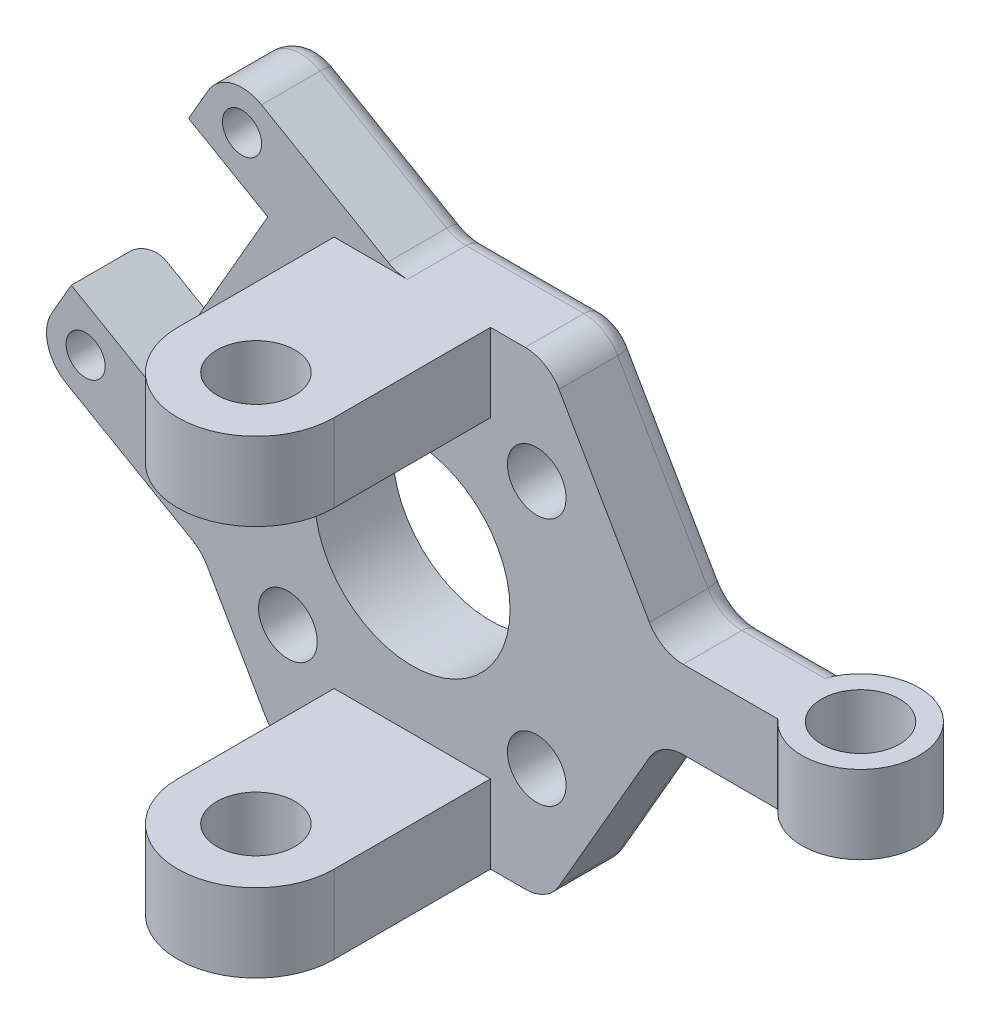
ISO-10303-21;
HEADER;
FILE_DESCRIPTION(('STEP AP214'),'2;1');
FILE_NAME('part.step','',(''),(''),'','','');
FILE_SCHEMA(('AUTOMOTIVE_DESIGN { 1 0 10303 214 1 1 1 1 }'));
ENDSEC;
DATA;
#1=APPLICATION_CONTEXT('core data for automotive mechanical design processes');
#2=APPLICATION_PROTOCOL_DEFINITION('international standard','automotive_design',2000,#1);
#3=PRODUCT_CONTEXT('',#1,'mechanical');
#4=PRODUCT('Part','Part','',(#3));
#5=PRODUCT_RELATED_PRODUCT_CATEGORY('part','',(#4));
#6=PRODUCT_DEFINITION_FORMATION('','',#4);
#7=PRODUCT_DEFINITION_CONTEXT('part definition',#1,'design');
#8=PRODUCT_DEFINITION('design','',#6,#7);
#9=PRODUCT_DEFINITION_SHAPE('','',#8);
#10=(LENGTH_UNIT() NAMED_UNIT(*) SI_UNIT(.MILLI.,.METRE.));
#11=(NAMED_UNIT(*) PLANE_ANGLE_UNIT() SI_UNIT($,.RADIAN.));
#12=(NAMED_UNIT(*) SI_UNIT($,.STERADIAN.) SOLID_ANGLE_UNIT());
#13=UNCERTAINTY_MEASURE_WITH_UNIT(LENGTH_MEASURE(1.E-05),#10,'distance_accuracy_value','');
#14=(GEOMETRIC_REPRESENTATION_CONTEXT(3) GLOBAL_UNCERTAINTY_ASSIGNED_CONTEXT((#13)) GLOBAL_UNIT_ASSIGNED_CONTEXT((#10,
#11,#12)) REPRESENTATION_CONTEXT('',''));
#15=CARTESIAN_POINT('',(0.,0.,0.));
#16=DIRECTION('',(0.,0.,1.));
#17=DIRECTION('',(1.,0.,0.));
#18=AXIS2_PLACEMENT_3D('',#15,#16,#17);
#19=CARTESIAN_POINT('',(20.,60.,80.));
#20=DIRECTION('',(-1.,0.,0.));
#21=DIRECTION('',(0.,-1.,0.));
#22=AXIS2_PLACEMENT_3D('',#19,#20,#21);
#23=PLANE('',#22);
#24=DIRECTION('',(0.,-1.,0.));
#25=VECTOR('',#24,1.);
#26=CARTESIAN_POINT('',(19.9999999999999,552.966319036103,60.));
#27=LINE('',#26,#25);
#28=CARTESIAN_POINT('',(20.,60.0000000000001,60.));
#29=VERTEX_POINT('',#28);
#30=CARTESIAN_POINT('',(20.,40.,60.));
#31=VERTEX_POINT('',#30);
#32=EDGE_CURVE('E648',#29,#31,#27,.T.);
#33=ORIENTED_EDGE('',*,*,#32,.T.);
#34=DIRECTION('',(0.,0.,-1.));
#35=VECTOR('',#34,1.);
#36=CARTESIAN_POINT('',(20.,40.,80.));
#37=LINE('',#36,#35);
#38=CARTESIAN_POINT('',(20.,40.,20.));
#39=VERTEX_POINT('',#38);
#40=EDGE_CURVE('E652',#31,#39,#37,.T.);
#41=ORIENTED_EDGE('',*,*,#40,.T.);
#42=DIRECTION('',(0.,1.,0.));
#43=VECTOR('',#42,1.);
#44=CARTESIAN_POINT('',(20.,60.,20.));
#45=LINE('',#44,#43);
#46=CARTESIAN_POINT('',(20.,60.,20.));
#47=VERTEX_POINT('',#46);
#48=EDGE_CURVE('E651',#39,#47,#45,.T.);
#49=ORIENTED_EDGE('',*,*,#48,.T.);
#50=DIRECTION('',(0.,0.,-1.));
#51=VECTOR('',#50,1.);
#52=CARTESIAN_POINT('',(20.,60.,80.));
#53=LINE('',#52,#51);
#54=EDGE_CURVE('E637',#29,#47,#53,.T.);
#55=ORIENTED_EDGE('',*,*,#54,.F.);
#56=EDGE_LOOP('',(#33,#41,#49,#55));
#57=FACE_BOUND('',#56,.T.);
#58=ADVANCED_FACE('F350',(#57),#23,.F.);
#59=CARTESIAN_POINT('',(20.,-60.,80.));
#60=DIRECTION('',(-1.,0.,0.));
#61=DIRECTION('',(0.,-1.,0.));
#62=AXIS2_PLACEMENT_3D('',#59,#60,#61);
#63=PLANE('',#62);
#64=CARTESIAN_POINT('',(20.,-40.,60.));
#65=VERTEX_POINT('',#64);
#66=CARTESIAN_POINT('',(20.,-59.9999999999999,60.));
#67=VERTEX_POINT('',#66);
#68=EDGE_CURVE('E657',#65,#67,#27,.T.);
#69=ORIENTED_EDGE('',*,*,#68,.T.);
#70=DIRECTION('',(0.,0.,-1.));
#71=VECTOR('',#70,1.);
#72=CARTESIAN_POINT('',(20.,-60.,80.));
#73=LINE('',#72,#71);
#74=CARTESIAN_POINT('',(20.,-60.,20.));
#75=VERTEX_POINT('',#74);
#76=EDGE_CURVE('E687',#67,#75,#73,.T.);
#77=ORIENTED_EDGE('',*,*,#76,.T.);
#78=DIRECTION('',(0.,1.,0.));
#79=VECTOR('',#78,1.);
#80=CARTESIAN_POINT('',(20.,-60.,20.));
#81=LINE('',#80,#79);
#82=CARTESIAN_POINT('',(20.,-40.,20.));
#83=VERTEX_POINT('',#82);
#84=EDGE_CURVE('E644',#75,#83,#81,.T.);
#85=ORIENTED_EDGE('',*,*,#84,.T.);
#86=DIRECTION('',(0.,0.,-1.));
#87=VECTOR('',#86,1.);
#88=CARTESIAN_POINT('',(20.,-40.,80.));
#89=LINE('',#88,#87);
#90=EDGE_CURVE('E685',#65,#83,#89,.T.);
#91=ORIENTED_EDGE('',*,*,#90,.F.);
#92=EDGE_LOOP('',(#69,#77,#85,#91));
#93=FACE_BOUND('',#92,.T.);
#94=ADVANCED_FACE('F1048',(#93),#63,.F.);
#95=CARTESIAN_POINT('',(34.6410161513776,-60.,20.));
#96=DIRECTION('',(0.,0.,-1.));
#97=DIRECTION('',(-1.,0.,0.));
#98=AXIS2_PLACEMENT_3D('',#95,#96,#97);
#99=PLANE('',#98);
#100=CARTESIAN_POINT('',(-31.819805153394,-31.8198051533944,20.));
#101=DIRECTION('',(0.,0.,1.));
#102=DIRECTION('',(1.,0.,0.));
#103=AXIS2_PLACEMENT_3D('',#100,#101,#102);
#104=CIRCLE('',#103,7.49999999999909);
#105=CARTESIAN_POINT('',(-24.3198051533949,-31.8198051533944,20.));
#106=VERTEX_POINT('',#105);
#107=EDGE_CURVE('E726',#106,#106,#104,.T.);
#108=ORIENTED_EDGE('',*,*,#107,.F.);
#109=EDGE_LOOP('',(#108));
#110=FACE_BOUND('',#109,.T.);
#111=CARTESIAN_POINT('',(31.8198051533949,31.8198051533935,20.));
#112=DIRECTION('',(0.,0.,1.));
#113=DIRECTION('',(1.,0.,0.));
#114=AXIS2_PLACEMENT_3D('',#111,#112,#113);
#115=CIRCLE('',#114,7.50000000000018);
#116=CARTESIAN_POINT('',(39.3198051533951,31.8198051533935,20.));
#117=VERTEX_POINT('',#116);
#118=EDGE_CURVE('E738',#117,#117,#115,.T.);
#119=ORIENTED_EDGE('',*,*,#118,.F.);
#120=EDGE_LOOP('',(#119));
#121=FACE_BOUND('',#120,.T.);
#122=CARTESIAN_POINT('',(-83.5640646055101,2.05771365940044,20.));
#123=DIRECTION('',(0.,0.,1.));
#124=DIRECTION('',(-1.,0.,0.));
#125=AXIS2_PLACEMENT_3D('',#122,#123,#124);
#126=CIRCLE('',#125,4.99999999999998);
#127=CARTESIAN_POINT('',(-88.5640646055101,2.05771365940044,20.));
#128=VERTEX_POINT('',#127);
#129=EDGE_CURVE('E741',#128,#128,#126,.T.);
#130=ORIENTED_EDGE('',*,*,#129,.F.);
#131=EDGE_LOOP('',(#130));
#132=FACE_BOUND('',#131,.T.);
#133=CARTESIAN_POINT('',(-43.5640646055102,71.3397459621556,20.));
#134=DIRECTION('',(0.,0.,1.));
#135=DIRECTION('',(1.,0.,0.));
#136=AXIS2_PLACEMENT_3D('',#133,#134,#135);
#137=CIRCLE('',#136,5.);
#138=CARTESIAN_POINT('',(-38.5640646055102,71.3397459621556,20.));
#139=VERTEX_POINT('',#138);
#140=EDGE_CURVE('E748',#139,#139,#137,.T.);
#141=ORIENTED_EDGE('',*,*,#140,.F.);
#142=EDGE_LOOP('',(#141));
#143=FACE_BOUND('',#142,.T.);
#144=CARTESIAN_POINT('',(0.,0.,20.));
#145=DIRECTION('',(0.,0.,1.));
#146=DIRECTION('',(1.,0.,0.));
#147=AXIS2_PLACEMENT_3D('',#144,#145,#146);
#148=CIRCLE('',#147,25.);
#149=CARTESIAN_POINT('',(25.,0.,20.));
#150=VERTEX_POINT('',#149);
#151=EDGE_CURVE('E795',#150,#150,#148,.T.);
#152=ORIENTED_EDGE('',*,*,#151,.F.);
#153=EDGE_LOOP('',(#152));
#154=FACE_BOUND('',#153,.T.);
#155=CARTESIAN_POINT('',(31.8198051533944,-31.8198051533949,20.));
#156=DIRECTION('',(0.,0.,1.));
#157=DIRECTION('',(1.,0.,0.));
#158=AXIS2_PLACEMENT_3D('',#155,#156,#157);
#159=CIRCLE('',#158,7.5);
#160=CARTESIAN_POINT('',(39.3198051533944,-31.8198051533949,20.));
#161=VERTEX_POINT('',#160);
#162=EDGE_CURVE('E732',#161,#161,#159,.T.);
#163=ORIENTED_EDGE('',*,*,#162,.F.);
#164=EDGE_LOOP('',(#163));
#165=FACE_BOUND('',#164,.T.);
#166=CARTESIAN_POINT('',(-31.8198051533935,31.819805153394,20.));
#167=DIRECTION('',(0.,0.,1.));
#168=DIRECTION('',(1.,0.,0.));
#169=AXIS2_PLACEMENT_3D('',#166,#167,#168);
#170=CIRCLE('',#169,7.4999999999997);
#171=CARTESIAN_POINT('',(-24.3198051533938,31.819805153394,20.));
#172=VERTEX_POINT('',#171);
#173=EDGE_CURVE('E720',#172,#172,#170,.T.);
#174=ORIENTED_EDGE('',*,*,#173,.F.);
#175=EDGE_LOOP('',(#174));
#176=FACE_BOUND('',#175,.T.);
#177=DIRECTION('',(-0.866025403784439,0.5,0.));
#178=VECTOR('',#177,1.);
#179=CARTESIAN_POINT('',(-3.92304845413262,60.,20.));
#180=LINE('',#179,#178);
#181=CARTESIAN_POINT('',(-6.24355652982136,61.3397459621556,20.));
#182=VERTEX_POINT('',#181);
#183=CARTESIAN_POINT('',(-38.5640646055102,80.,20.));
#184=VERTEX_POINT('',#183);
#185=EDGE_CURVE('E758',#182,#184,#180,.T.);
#186=ORIENTED_EDGE('',*,*,#185,.T.);
#187=CARTESIAN_POINT('',(-43.5640646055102,71.3397459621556,20.));
#188=DIRECTION('',(0.,0.,-1.));
#189=DIRECTION('',(-1.,0.,0.));
#190=AXIS2_PLACEMENT_3D('',#187,#188,#189);
#191=CIRCLE('',#190,10.);
#192=CARTESIAN_POINT('',(-52.2243186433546,76.3397459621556,20.));
#193=VERTEX_POINT('',#192);
#194=EDGE_CURVE('E835',#184,#193,#191,.F.);
#195=ORIENTED_EDGE('',*,*,#194,.T.);
#196=DIRECTION('',(-0.5,-0.866025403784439,0.));
#197=VECTOR('',#196,1.);
#198=CARTESIAN_POINT('',(-57.2243186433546,67.6794919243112,20.));
#199=LINE('',#198,#197);
#200=CARTESIAN_POINT('',(-57.2243186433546,67.6794919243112,20.));
#201=VERTEX_POINT('',#200);
#202=EDGE_CURVE('E761',#193,#201,#199,.T.);
#203=ORIENTED_EDGE('',*,*,#202,.T.);
#204=DIRECTION('',(0.866025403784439,-0.499999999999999,0.));
#205=VECTOR('',#204,1.);
#206=CARTESIAN_POINT('',(-57.2243186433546,67.6794919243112,20.));
#207=LINE('',#206,#205);
#208=CARTESIAN_POINT('',(-36.9615242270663,55.9807621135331,20.));
#209=VERTEX_POINT('',#208);
#210=EDGE_CURVE('E764',#201,#209,#207,.T.);
#211=ORIENTED_EDGE('',*,*,#210,.T.);
#212=DIRECTION('',(-0.5,-0.866025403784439,0.));
#213=VECTOR('',#212,1.);
#214=CARTESIAN_POINT('',(-34.6410161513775,60.,20.));
#215=LINE('',#214,#213);
#216=CARTESIAN_POINT('',(-66.9615242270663,4.01923788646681,20.));
#217=VERTEX_POINT('',#216);
#218=EDGE_CURVE('E809',#209,#217,#215,.T.);
#219=ORIENTED_EDGE('',*,*,#218,.T.);
#220=DIRECTION('',(-0.866025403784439,0.5,0.));
#221=VECTOR('',#220,1.);
#222=CARTESIAN_POINT('',(-66.9615242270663,4.01923788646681,20.));
#223=LINE('',#222,#221);
#224=CARTESIAN_POINT('',(-87.2243186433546,15.7179676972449,20.));
#225=VERTEX_POINT('',#224);
#226=EDGE_CURVE('E766',#217,#225,#223,.T.);
#227=ORIENTED_EDGE('',*,*,#226,.T.);
#228=DIRECTION('',(-0.5,-0.866025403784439,0.));
#229=VECTOR('',#228,1.);
#230=CARTESIAN_POINT('',(-97.2243186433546,-1.6025403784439,20.));
#231=LINE('',#230,#229);
#232=CARTESIAN_POINT('',(-92.2243186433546,7.05771365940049,20.));
#233=VERTEX_POINT('',#232);
#234=EDGE_CURVE('E769',#225,#233,#231,.T.);
#235=ORIENTED_EDGE('',*,*,#234,.T.);
#236=CARTESIAN_POINT('',(-83.5640646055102,2.05771365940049,20.));
#237=DIRECTION('',(0.,0.,-1.));
#238=DIRECTION('',(-1.,0.,0.));
#239=AXIS2_PLACEMENT_3D('',#236,#237,#238);
#240=CIRCLE('',#239,10.);
#241=CARTESIAN_POINT('',(-88.5640646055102,-6.6025403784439,20.));
#242=VERTEX_POINT('',#241);
#243=EDGE_CURVE('E833',#233,#242,#240,.F.);
#244=ORIENTED_EDGE('',*,*,#243,.T.);
#245=DIRECTION('',(0.866025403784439,-0.5,0.));
#246=VECTOR('',#245,1.);
#247=CARTESIAN_POINT('',(-53.9230484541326,-26.6025403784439,20.));
#248=LINE('',#247,#246);
#249=CARTESIAN_POINT('',(-56.2435565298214,-25.2627944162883,20.));
#250=VERTEX_POINT('',#249);
#251=EDGE_CURVE('E755',#242,#250,#248,.T.);
#252=ORIENTED_EDGE('',*,*,#251,.T.);
#253=CARTESIAN_POINT('',(-61.2435565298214,-33.9230484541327,20.));
#254=DIRECTION('',(0.,0.,-1.));
#255=DIRECTION('',(-1.,0.,0.));
#256=AXIS2_PLACEMENT_3D('',#253,#254,#255);
#257=CIRCLE('',#256,10.);
#258=CARTESIAN_POINT('',(-52.583302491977,-28.9230484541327,20.));
#259=VERTEX_POINT('',#258);
#260=EDGE_CURVE('E875',#250,#259,#257,.T.);
#261=ORIENTED_EDGE('',*,*,#260,.T.);
#262=DIRECTION('',(0.5,-0.866025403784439,0.));
#263=VECTOR('',#262,1.);
#264=CARTESIAN_POINT('',(-69.2820323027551,0.,20.));
#265=LINE('',#264,#263);
#266=CARTESIAN_POINT('',(-37.5277674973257,-55.,20.));
#267=VERTEX_POINT('',#266);
#268=EDGE_CURVE('E812',#259,#267,#265,.T.);
#269=ORIENTED_EDGE('',*,*,#268,.T.);
#270=CARTESIAN_POINT('',(-28.8675134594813,-50.,20.));
#271=DIRECTION('',(0.,0.,-1.));
#272=DIRECTION('',(-1.,0.,0.));
#273=AXIS2_PLACEMENT_3D('',#270,#271,#272);
#274=CIRCLE('',#273,10.);
#275=CARTESIAN_POINT('',(-28.8675134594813,-60.,20.));
#276=VERTEX_POINT('',#275);
#277=EDGE_CURVE('E831',#267,#276,#274,.F.);
#278=ORIENTED_EDGE('',*,*,#277,.T.);
#279=DIRECTION('',(1.,0.,0.));
#280=VECTOR('',#279,1.);
#281=CARTESIAN_POINT('',(-34.6410161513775,-60.,20.));
#282=LINE('',#281,#280);
#283=CARTESIAN_POINT('',(-20.,-60.,20.));
#284=VERTEX_POINT('',#283);
#285=EDGE_CURVE('E816',#276,#284,#282,.T.);
#286=ORIENTED_EDGE('',*,*,#285,.T.);
#287=DIRECTION('',(0.,-1.,0.));
#288=VECTOR('',#287,1.);
#289=CARTESIAN_POINT('',(-20.,-60.,20.));
#290=LINE('',#289,#288);
#291=CARTESIAN_POINT('',(-20.,-40.,20.));
#292=VERTEX_POINT('',#291);
#293=EDGE_CURVE('E677',#292,#284,#290,.T.);
#294=ORIENTED_EDGE('',*,*,#293,.F.);
#295=DIRECTION('',(-1.,0.,0.));
#296=VECTOR('',#295,1.);
#297=CARTESIAN_POINT('',(-20.,-40.,20.));
#298=LINE('',#297,#296);
#299=EDGE_CURVE('E674',#83,#292,#298,.T.);
#300=ORIENTED_EDGE('',*,*,#299,.F.);
#301=ORIENTED_EDGE('',*,*,#84,.F.);
#302=CARTESIAN_POINT('',(28.8675134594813,-60.,20.));
#303=VERTEX_POINT('',#302);
#304=EDGE_CURVE('E815',#75,#303,#282,.T.);
#305=ORIENTED_EDGE('',*,*,#304,.T.);
#306=CARTESIAN_POINT('',(28.8675134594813,-50.,20.));
#307=DIRECTION('',(0.,0.,-1.));
#308=DIRECTION('',(-1.,0.,0.));
#309=AXIS2_PLACEMENT_3D('',#306,#307,#308);
#310=CIRCLE('',#309,10.);
#311=CARTESIAN_POINT('',(37.5277674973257,-55.,20.));
#312=VERTEX_POINT('',#311);
#313=EDGE_CURVE('E829',#303,#312,#310,.F.);
#314=ORIENTED_EDGE('',*,*,#313,.T.);
#315=DIRECTION('',(0.5,0.866025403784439,0.));
#316=VECTOR('',#315,1.);
#317=CARTESIAN_POINT('',(34.6410161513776,-60.,20.));
#318=LINE('',#317,#316);
#319=CARTESIAN_POINT('',(60.6217782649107,-15.,20.));
#320=VERTEX_POINT('',#319);
#321=EDGE_CURVE('E801',#312,#320,#318,.T.);
#322=ORIENTED_EDGE('',*,*,#321,.T.);
#323=CARTESIAN_POINT('',(69.2820323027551,-20.,20.));
#324=DIRECTION('',(0.,0.,-1.));
#325=DIRECTION('',(-1.,0.,0.));
#326=AXIS2_PLACEMENT_3D('',#323,#324,#325);
#327=CIRCLE('',#326,10.);
#328=CARTESIAN_POINT('',(69.2820323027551,-9.99999999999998,20.));
#329=VERTEX_POINT('',#328);
#330=EDGE_CURVE('E877',#320,#329,#327,.T.);
#331=ORIENTED_EDGE('',*,*,#330,.T.);
#332=DIRECTION('',(1.,0.,0.));
#333=VECTOR('',#332,1.);
#334=CARTESIAN_POINT('',(34.6410161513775,-9.99999999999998,20.));
#335=LINE('',#334,#333);
#336=CARTESIAN_POINT('',(93.4606762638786,-9.99999999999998,20.));
#337=VERTEX_POINT('',#336);
#338=EDGE_CURVE('E780',#329,#337,#335,.T.);
#339=ORIENTED_EDGE('',*,*,#338,.T.);
#340=DIRECTION('',(0.,1.,0.));
#341=VECTOR('',#340,1.);
#342=CARTESIAN_POINT('',(93.4606762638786,-9.99999999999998,20.));
#343=LINE('',#342,#341);
#344=CARTESIAN_POINT('',(93.4606762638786,10.,20.));
#345=VERTEX_POINT('',#344);
#346=EDGE_CURVE('E715',#337,#345,#343,.T.);
#347=ORIENTED_EDGE('',*,*,#346,.T.);
#348=DIRECTION('',(-1.,0.,0.));
#349=VECTOR('',#348,1.);
#350=CARTESIAN_POINT('',(34.6410161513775,9.99999999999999,20.));
#351=LINE('',#350,#349);
#352=CARTESIAN_POINT('',(69.2820323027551,10.,20.));
#353=VERTEX_POINT('',#352);
#354=EDGE_CURVE('E789',#345,#353,#351,.T.);
#355=ORIENTED_EDGE('',*,*,#354,.T.);
#356=CARTESIAN_POINT('',(69.2820323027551,20.,20.));
#357=DIRECTION('',(0.,0.,-1.));
#358=DIRECTION('',(-1.,0.,0.));
#359=AXIS2_PLACEMENT_3D('',#356,#357,#358);
#360=CIRCLE('',#359,10.);
#361=CARTESIAN_POINT('',(60.6217782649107,15.,20.));
#362=VERTEX_POINT('',#361);
#363=EDGE_CURVE('E881',#353,#362,#360,.T.);
#364=ORIENTED_EDGE('',*,*,#363,.T.);
#365=DIRECTION('',(-0.5,0.866025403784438,0.));
#366=VECTOR('',#365,1.);
#367=CARTESIAN_POINT('',(69.2820323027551,0.,20.));
#368=LINE('',#367,#366);
#369=CARTESIAN_POINT('',(37.5277674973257,55.,20.));
#370=VERTEX_POINT('',#369);
#371=EDGE_CURVE('E804',#362,#370,#368,.T.);
#372=ORIENTED_EDGE('',*,*,#371,.T.);
#373=CARTESIAN_POINT('',(28.8675134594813,50.,20.));
#374=DIRECTION('',(0.,0.,-1.));
#375=DIRECTION('',(-1.,0.,0.));
#376=AXIS2_PLACEMENT_3D('',#373,#374,#375);
#377=CIRCLE('',#376,10.);
#378=CARTESIAN_POINT('',(28.8675134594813,60.,20.));
#379=VERTEX_POINT('',#378);
#380=EDGE_CURVE('E827',#370,#379,#377,.F.);
#381=ORIENTED_EDGE('',*,*,#380,.T.);
#382=DIRECTION('',(-1.,0.,0.));
#383=VECTOR('',#382,1.);
#384=CARTESIAN_POINT('',(34.6410161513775,60.,20.));
#385=LINE('',#384,#383);
#386=EDGE_CURVE('E807',#379,#47,#385,.T.);
#387=ORIENTED_EDGE('',*,*,#386,.T.);
#388=ORIENTED_EDGE('',*,*,#48,.F.);
#389=DIRECTION('',(1.,0.,0.));
#390=VECTOR('',#389,1.);
#391=CARTESIAN_POINT('',(-20.,40.,20.));
#392=LINE('',#391,#390);
#393=CARTESIAN_POINT('',(-20.,40.,20.));
#394=VERTEX_POINT('',#393);
#395=EDGE_CURVE('E692',#394,#39,#392,.T.);
#396=ORIENTED_EDGE('',*,*,#395,.F.);
#397=DIRECTION('',(0.,-1.,0.));
#398=VECTOR('',#397,1.);
#399=CARTESIAN_POINT('',(-20.,60.,20.));
#400=LINE('',#399,#398);
#401=CARTESIAN_POINT('',(-20.,60.,20.));
#402=VERTEX_POINT('',#401);
#403=EDGE_CURVE('E689',#402,#394,#400,.T.);
#404=ORIENTED_EDGE('',*,*,#403,.F.);
#405=DIRECTION('',(-1.,0.,0.));
#406=VECTOR('',#405,1.);
#407=CARTESIAN_POINT('',(-20.,60.,20.));
#408=LINE('',#407,#406);
#409=CARTESIAN_POINT('',(-1.24355652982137,60.,20.));
#410=VERTEX_POINT('',#409);
#411=EDGE_CURVE('E696',#410,#402,#408,.T.);
#412=ORIENTED_EDGE('',*,*,#411,.F.);
#413=CARTESIAN_POINT('',(-1.24355652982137,70.,20.));
#414=DIRECTION('',(0.,0.,-1.));
#415=DIRECTION('',(-1.,0.,0.));
#416=AXIS2_PLACEMENT_3D('',#413,#414,#415);
#417=CIRCLE('',#416,10.);
#418=EDGE_CURVE('E879',#410,#182,#417,.T.);
#419=ORIENTED_EDGE('',*,*,#418,.T.);
#420=EDGE_LOOP('',(#186,#195,#203,#211,#219,#227,#235,#244,#252,#261,#269,#278,#286,#294,#300,
#301,#305,#314,#322,#331,#339,#347,#355,#364,#372,#381,#387,#388,#396,#404,#412,#419));
#421=FACE_BOUND('',#420,.T.);
#422=ADVANCED_FACE('F1044',(#110,#121,#132,#143,#154,#165,#176,#421),#99,.F.);
#423=CARTESIAN_POINT('',(34.6410161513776,-60.,0.));
#424=DIRECTION('',(0.,0.,-1.));
#425=DIRECTION('',(-1.,0.,0.));
#426=AXIS2_PLACEMENT_3D('',#423,#424,#425);
#427=PLANE('',#426);
#428=CARTESIAN_POINT('',(-31.819805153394,-31.8198051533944,0.));
#429=DIRECTION('',(0.,0.,1.));
#430=DIRECTION('',(1.,0.,0.));
#431=AXIS2_PLACEMENT_3D('',#428,#429,#430);
#432=CIRCLE('',#431,7.49999999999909);
#433=CARTESIAN_POINT('',(-24.3198051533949,-31.8198051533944,0.));
#434=VERTEX_POINT('',#433);
#435=EDGE_CURVE('E723',#434,#434,#432,.T.);
#436=ORIENTED_EDGE('',*,*,#435,.T.);
#437=EDGE_LOOP('',(#436));
#438=FACE_BOUND('',#437,.T.);
#439=CARTESIAN_POINT('',(31.8198051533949,31.8198051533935,0.));
#440=DIRECTION('',(0.,0.,1.));
#441=DIRECTION('',(1.,0.,0.));
#442=AXIS2_PLACEMENT_3D('',#439,#440,#441);
#443=CIRCLE('',#442,7.50000000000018);
#444=CARTESIAN_POINT('',(39.3198051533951,31.8198051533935,0.));
#445=VERTEX_POINT('',#444);
#446=EDGE_CURVE('E735',#445,#445,#443,.T.);
#447=ORIENTED_EDGE('',*,*,#446,.T.);
#448=EDGE_LOOP('',(#447));
#449=FACE_BOUND('',#448,.T.);
#450=CARTESIAN_POINT('',(-83.5640646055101,2.05771365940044,0.));
#451=DIRECTION('',(0.,0.,1.));
#452=DIRECTION('',(-1.,0.,0.));
#453=AXIS2_PLACEMENT_3D('',#450,#451,#452);
#454=CIRCLE('',#453,4.99999999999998);
#455=CARTESIAN_POINT('',(-86.0640646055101,-2.27241335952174,0.));
#456=VERTEX_POINT('',#455);
#457=CARTESIAN_POINT('',(-87.8941916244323,4.55771365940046,0.));
#458=VERTEX_POINT('',#457);
#459=EDGE_CURVE('E745',#456,#458,#454,.T.);
#460=ORIENTED_EDGE('',*,*,#459,.T.);
#461=DIRECTION('',(-0.5,-0.866025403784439,0.));
#462=VECTOR('',#461,1.);
#463=CARTESIAN_POINT('',(-85.2146997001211,9.19872981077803,0.));
#464=LINE('',#463,#462);
#465=CARTESIAN_POINT('',(-82.8941916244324,13.2179676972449,0.));
#466=VERTEX_POINT('',#465);
#467=EDGE_CURVE('E920',#458,#466,#464,.F.);
#468=ORIENTED_EDGE('',*,*,#467,.T.);
#469=DIRECTION('',(-0.866025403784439,0.5,0.));
#470=VECTOR('',#469,1.);
#471=CARTESIAN_POINT('',(-66.9615242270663,4.01923788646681,0.));
#472=LINE('',#471,#470);
#473=CARTESIAN_POINT('',(-66.9615242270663,4.01923788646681,0.));
#474=VERTEX_POINT('',#473);
#475=EDGE_CURVE('E774',#474,#466,#472,.T.);
#476=ORIENTED_EDGE('',*,*,#475,.F.);
#477=DIRECTION('',(-0.5,-0.866025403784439,0.));
#478=VECTOR('',#477,1.);
#479=CARTESIAN_POINT('',(-34.6410161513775,60.,0.));
#480=LINE('',#479,#478);
#481=CARTESIAN_POINT('',(-36.9615242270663,55.9807621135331,0.));
#482=VERTEX_POINT('',#481);
#483=EDGE_CURVE('E798',#482,#474,#480,.T.);
#484=ORIENTED_EDGE('',*,*,#483,.F.);
#485=DIRECTION('',(0.866025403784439,-0.499999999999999,0.));
#486=VECTOR('',#485,1.);
#487=CARTESIAN_POINT('',(-57.2243186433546,67.6794919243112,0.));
#488=LINE('',#487,#486);
#489=CARTESIAN_POINT('',(-52.8941916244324,65.1794919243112,0.));
#490=VERTEX_POINT('',#489);
#491=EDGE_CURVE('E772',#490,#482,#488,.T.);
#492=ORIENTED_EDGE('',*,*,#491,.F.);
#493=DIRECTION('',(-0.5,-0.866025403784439,0.));
#494=VECTOR('',#493,1.);
#495=CARTESIAN_POINT('',(-85.2146997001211,9.19872981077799,0.));
#496=LINE('',#495,#494);
#497=CARTESIAN_POINT('',(-47.8941916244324,73.8397459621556,0.));
#498=VERTEX_POINT('',#497);
#499=EDGE_CURVE('E918',#490,#498,#496,.F.);
#500=ORIENTED_EDGE('',*,*,#499,.T.);
#501=CARTESIAN_POINT('',(-43.5640646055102,71.3397459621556,0.));
#502=DIRECTION('',(0.,0.,1.));
#503=DIRECTION('',(1.,0.,0.));
#504=AXIS2_PLACEMENT_3D('',#501,#502,#503);
#505=CIRCLE('',#504,5.);
#506=CARTESIAN_POINT('',(-41.0640646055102,75.6698729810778,0.));
#507=VERTEX_POINT('',#506);
#508=EDGE_CURVE('E751',#498,#507,#505,.T.);
#509=ORIENTED_EDGE('',*,*,#508,.T.);
#510=DIRECTION('',(-0.866025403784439,0.5,0.));
#511=VECTOR('',#510,1.);
#512=CARTESIAN_POINT('',(74.4615242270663,8.97114317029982,0.));
#513=LINE('',#512,#511);
#514=CARTESIAN_POINT('',(-8.74355652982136,57.0096189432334,0.));
#515=VERTEX_POINT('',#514);
#516=EDGE_CURVE('E894',#507,#515,#513,.F.);
#517=ORIENTED_EDGE('',*,*,#516,.T.);
#518=CARTESIAN_POINT('',(-1.24355652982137,70.,0.));
#519=DIRECTION('',(0.,0.,-1.));
#520=DIRECTION('',(-1.,0.,0.));
#521=AXIS2_PLACEMENT_3D('',#518,#519,#520);
#522=CIRCLE('',#521,15.);
#523=CARTESIAN_POINT('',(-1.24355652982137,55.,0.));
#524=VERTEX_POINT('',#523);
#525=EDGE_CURVE('E892',#515,#524,#522,.F.);
#526=ORIENTED_EDGE('',*,*,#525,.T.);
#527=DIRECTION('',(-1.,0.,0.));
#528=VECTOR('',#527,1.);
#529=CARTESIAN_POINT('',(28.8675134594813,55.,0.));
#530=LINE('',#529,#528);
#531=CARTESIAN_POINT('',(28.8675134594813,55.,0.));
#532=VERTEX_POINT('',#531);
#533=EDGE_CURVE('E890',#524,#532,#530,.F.);
#534=ORIENTED_EDGE('',*,*,#533,.T.);
#535=CARTESIAN_POINT('',(28.8675134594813,50.,0.));
#536=DIRECTION('',(0.,0.,-1.));
#537=DIRECTION('',(-1.,0.,0.));
#538=AXIS2_PLACEMENT_3D('',#535,#536,#537);
#539=CIRCLE('',#538,5.);
#540=CARTESIAN_POINT('',(33.1976404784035,52.5,0.));
#541=VERTEX_POINT('',#540);
#542=EDGE_CURVE('E888',#532,#541,#539,.T.);
#543=ORIENTED_EDGE('',*,*,#542,.T.);
#544=DIRECTION('',(-0.5,0.866025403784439,0.));
#545=VECTOR('',#544,1.);
#546=CARTESIAN_POINT('',(56.2916512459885,12.5,0.));
#547=LINE('',#546,#545);
#548=CARTESIAN_POINT('',(56.2916512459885,12.5,0.));
#549=VERTEX_POINT('',#548);
#550=EDGE_CURVE('E886',#541,#549,#547,.F.);
#551=ORIENTED_EDGE('',*,*,#550,.T.);
#552=CARTESIAN_POINT('',(69.2820323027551,20.,0.));
#553=DIRECTION('',(0.,0.,-1.));
#554=DIRECTION('',(-1.,0.,0.));
#555=AXIS2_PLACEMENT_3D('',#552,#553,#554);
#556=CIRCLE('',#555,15.);
#557=CARTESIAN_POINT('',(69.2820323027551,5.00000000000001,0.));
#558=VERTEX_POINT('',#557);
#559=EDGE_CURVE('E896',#549,#558,#556,.F.);
#560=ORIENTED_EDGE('',*,*,#559,.T.);
#561=DIRECTION('',(-1.,0.,0.));
#562=VECTOR('',#561,1.);
#563=CARTESIAN_POINT('',(34.6410161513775,5.,0.));
#564=LINE('',#563,#562);
#565=CARTESIAN_POINT('',(93.4606762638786,5.00000000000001,0.));
#566=VERTEX_POINT('',#565);
#567=EDGE_CURVE('E898',#558,#566,#564,.F.);
#568=ORIENTED_EDGE('',*,*,#567,.T.);
#569=DIRECTION('',(0.,1.,0.));
#570=VECTOR('',#569,1.);
#571=CARTESIAN_POINT('',(93.4606762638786,-9.99999999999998,0.));
#572=LINE('',#571,#570);
#573=CARTESIAN_POINT('',(93.4606762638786,-4.99999999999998,0.));
#574=VERTEX_POINT('',#573);
#575=EDGE_CURVE('E712',#574,#566,#572,.T.);
#576=ORIENTED_EDGE('',*,*,#575,.F.);
#577=DIRECTION('',(1.,0.,0.));
#578=VECTOR('',#577,1.);
#579=CARTESIAN_POINT('',(34.6410161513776,-4.99999999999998,0.));
#580=LINE('',#579,#578);
#581=CARTESIAN_POINT('',(69.2820323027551,-4.99999999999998,0.));
#582=VERTEX_POINT('',#581);
#583=EDGE_CURVE('E912',#574,#582,#580,.F.);
#584=ORIENTED_EDGE('',*,*,#583,.T.);
#585=CARTESIAN_POINT('',(69.2820323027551,-20.,0.));
#586=DIRECTION('',(0.,0.,-1.));
#587=DIRECTION('',(-1.,0.,0.));
#588=AXIS2_PLACEMENT_3D('',#585,#586,#587);
#589=CIRCLE('',#588,15.);
#590=CARTESIAN_POINT('',(56.2916512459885,-12.5,0.));
#591=VERTEX_POINT('',#590);
#592=EDGE_CURVE('E910',#582,#591,#589,.F.);
#593=ORIENTED_EDGE('',*,*,#592,.T.);
#594=DIRECTION('',(0.5,0.866025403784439,0.));
#595=VECTOR('',#594,1.);
#596=CARTESIAN_POINT('',(33.1976404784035,-52.5,0.));
#597=LINE('',#596,#595);
#598=CARTESIAN_POINT('',(33.1976404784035,-52.5,0.));
#599=VERTEX_POINT('',#598);
#600=EDGE_CURVE('E908',#591,#599,#597,.F.);
#601=ORIENTED_EDGE('',*,*,#600,.T.);
#602=CARTESIAN_POINT('',(28.8675134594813,-50.,0.));
#603=DIRECTION('',(0.,0.,-1.));
#604=DIRECTION('',(-1.,0.,0.));
#605=AXIS2_PLACEMENT_3D('',#602,#603,#604);
#606=CIRCLE('',#605,5.);
#607=CARTESIAN_POINT('',(28.8675134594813,-55.,0.));
#608=VERTEX_POINT('',#607);
#609=EDGE_CURVE('E906',#599,#608,#606,.T.);
#610=ORIENTED_EDGE('',*,*,#609,.T.);
#611=DIRECTION('',(1.,0.,0.));
#612=VECTOR('',#611,1.);
#613=CARTESIAN_POINT('',(-28.8675134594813,-55.,0.));
#614=LINE('',#613,#612);
#615=CARTESIAN_POINT('',(-28.8675134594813,-55.,0.));
#616=VERTEX_POINT('',#615);
#617=EDGE_CURVE('E904',#608,#616,#614,.F.);
#618=ORIENTED_EDGE('',*,*,#617,.T.);
#619=CARTESIAN_POINT('',(-28.8675134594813,-50.,0.));
#620=DIRECTION('',(0.,0.,-1.));
#621=DIRECTION('',(-1.,0.,0.));
#622=AXIS2_PLACEMENT_3D('',#619,#620,#621);
#623=CIRCLE('',#622,5.);
#624=CARTESIAN_POINT('',(-33.1976404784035,-52.5,0.));
#625=VERTEX_POINT('',#624);
#626=EDGE_CURVE('E902',#616,#625,#623,.T.);
#627=ORIENTED_EDGE('',*,*,#626,.T.);
#628=DIRECTION('',(0.5,-0.866025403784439,0.));
#629=VECTOR('',#628,1.);
#630=CARTESIAN_POINT('',(-48.2531754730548,-26.4230484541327,0.));
#631=LINE('',#630,#629);
#632=CARTESIAN_POINT('',(-48.2531754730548,-26.4230484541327,0.));
#633=VERTEX_POINT('',#632);
#634=EDGE_CURVE('E900',#625,#633,#631,.F.);
#635=ORIENTED_EDGE('',*,*,#634,.T.);
#636=CARTESIAN_POINT('',(-61.2435565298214,-33.9230484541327,0.));
#637=DIRECTION('',(0.,0.,-1.));
#638=DIRECTION('',(-1.,0.,0.));
#639=AXIS2_PLACEMENT_3D('',#636,#637,#638);
#640=CIRCLE('',#639,15.);
#641=CARTESIAN_POINT('',(-53.7435565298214,-20.9326673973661,0.));
#642=VERTEX_POINT('',#641);
#643=EDGE_CURVE('E914',#633,#642,#640,.F.);
#644=ORIENTED_EDGE('',*,*,#643,.T.);
#645=DIRECTION('',(0.866025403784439,-0.5,0.));
#646=VECTOR('',#645,1.);
#647=CARTESIAN_POINT('',(29.4615242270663,-68.9711431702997,0.));
#648=LINE('',#647,#646);
#649=EDGE_CURVE('E916',#642,#456,#648,.F.);
#650=ORIENTED_EDGE('',*,*,#649,.T.);
#651=EDGE_LOOP('',(#460,#468,#476,#484,#492,#500,#509,#517,#526,#534,#543,#551,#560,#568,#576,
#584,#593,#601,#610,#618,#627,#635,#644,#650));
#652=FACE_BOUND('',#651,.T.);
#653=CARTESIAN_POINT('',(0.,0.,0.));
#654=DIRECTION('',(0.,0.,1.));
#655=DIRECTION('',(1.,0.,0.));
#656=AXIS2_PLACEMENT_3D('',#653,#654,#655);
#657=CIRCLE('',#656,25.);
#658=CARTESIAN_POINT('',(25.,0.,0.));
#659=VERTEX_POINT('',#658);
#660=EDGE_CURVE('E792',#659,#659,#657,.T.);
#661=ORIENTED_EDGE('',*,*,#660,.T.);
#662=EDGE_LOOP('',(#661));
#663=FACE_BOUND('',#662,.T.);
#664=CARTESIAN_POINT('',(31.8198051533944,-31.8198051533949,0.));
#665=DIRECTION('',(0.,0.,1.));
#666=DIRECTION('',(1.,0.,0.));
#667=AXIS2_PLACEMENT_3D('',#664,#665,#666);
#668=CIRCLE('',#667,7.5);
#669=CARTESIAN_POINT('',(39.3198051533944,-31.8198051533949,0.));
#670=VERTEX_POINT('',#669);
#671=EDGE_CURVE('E729',#670,#670,#668,.T.);
#672=ORIENTED_EDGE('',*,*,#671,.T.);
#673=EDGE_LOOP('',(#672));
#674=FACE_BOUND('',#673,.T.);
#675=CARTESIAN_POINT('',(-31.8198051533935,31.819805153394,0.));
#676=DIRECTION('',(0.,0.,1.));
#677=DIRECTION('',(1.,0.,0.));
#678=AXIS2_PLACEMENT_3D('',#675,#676,#677);
#679=CIRCLE('',#678,7.4999999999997);
#680=CARTESIAN_POINT('',(-24.3198051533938,31.819805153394,0.));
#681=VERTEX_POINT('',#680);
#682=EDGE_CURVE('E717',#681,#681,#679,.T.);
#683=ORIENTED_EDGE('',*,*,#682,.T.);
#684=EDGE_LOOP('',(#683));
#685=FACE_BOUND('',#684,.T.);
#686=ADVANCED_FACE('F1041',(#438,#449,#652,#663,#674,#685),#427,.T.);
#687=CARTESIAN_POINT('',(34.6410161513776,-60.,20.));
#688=DIRECTION('',(-0.866025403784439,0.5,0.));
#689=DIRECTION('',(-0.5,-0.866025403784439,0.));
#690=AXIS2_PLACEMENT_3D('',#687,#688,#689);
#691=PLANE('',#690);
#692=DIRECTION('',(0.,0.,-1.));
#693=VECTOR('',#692,1.);
#694=CARTESIAN_POINT('',(37.5277674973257,-55.,20.));
#695=LINE('',#694,#693);
#696=CARTESIAN_POINT('',(37.5277674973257,-55.,5.));
#697=VERTEX_POINT('',#696);
#698=EDGE_CURVE('E859',#312,#697,#695,.T.);
#699=ORIENTED_EDGE('',*,*,#698,.T.);
#700=DIRECTION('',(0.5,0.866025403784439,0.));
#701=VECTOR('',#700,1.);
#702=CARTESIAN_POINT('',(60.6217782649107,-15.,5.));
#703=LINE('',#702,#701);
#704=CARTESIAN_POINT('',(60.6217782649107,-15.,5.));
#705=VERTEX_POINT('',#704);
#706=EDGE_CURVE('E935',#697,#705,#703,.T.);
#707=ORIENTED_EDGE('',*,*,#706,.T.);
#708=DIRECTION('',(0.,0.,1.));
#709=VECTOR('',#708,1.);
#710=CARTESIAN_POINT('',(60.6217782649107,-15.,20.));
#711=LINE('',#710,#709);
#712=EDGE_CURVE('E857',#705,#320,#711,.T.);
#713=ORIENTED_EDGE('',*,*,#712,.T.);
#714=ORIENTED_EDGE('',*,*,#321,.F.);
#715=EDGE_LOOP('',(#699,#707,#713,#714));
#716=FACE_BOUND('',#715,.T.);
#717=ADVANCED_FACE('F352',(#716),#691,.F.);
#718=CARTESIAN_POINT('',(69.2820323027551,0.,20.));
#719=DIRECTION('',(-0.866025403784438,-0.5,0.));
#720=DIRECTION('',(0.5,-0.866025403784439,0.));
#721=AXIS2_PLACEMENT_3D('',#718,#719,#720);
#722=PLANE('',#721);
#723=DIRECTION('',(0.,0.,-1.));
#724=VECTOR('',#723,1.);
#725=CARTESIAN_POINT('',(60.6217782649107,15.,20.));
#726=LINE('',#725,#724);
#727=CARTESIAN_POINT('',(60.6217782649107,15.,5.));
#728=VERTEX_POINT('',#727);
#729=EDGE_CURVE('E871',#362,#728,#726,.T.);
#730=ORIENTED_EDGE('',*,*,#729,.T.);
#731=DIRECTION('',(-0.5,0.866025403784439,0.));
#732=VECTOR('',#731,1.);
#733=CARTESIAN_POINT('',(37.5277674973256,55.,5.));
#734=LINE('',#733,#732);
#735=CARTESIAN_POINT('',(37.5277674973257,55.,5.));
#736=VERTEX_POINT('',#735);
#737=EDGE_CURVE('E370',#728,#736,#734,.T.);
#738=ORIENTED_EDGE('',*,*,#737,.T.);
#739=DIRECTION('',(0.,0.,-1.));
#740=VECTOR('',#739,1.);
#741=CARTESIAN_POINT('',(37.5277674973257,55.,20.));
#742=LINE('',#741,#740);
#743=EDGE_CURVE('E869',#736,#370,#742,.F.);
#744=ORIENTED_EDGE('',*,*,#743,.T.);
#745=ORIENTED_EDGE('',*,*,#371,.F.);
#746=EDGE_LOOP('',(#730,#738,#744,#745));
#747=FACE_BOUND('',#746,.T.);
#748=ADVANCED_FACE('F1062',(#747),#722,.F.);
#749=CARTESIAN_POINT('',(34.6410161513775,60.,20.));
#750=DIRECTION('',(0.,-1.,0.));
#751=DIRECTION('',(1.,0.,0.));
#752=AXIS2_PLACEMENT_3D('',#749,#750,#751);
#753=PLANE('',#752);
#754=CARTESIAN_POINT('',(0.,60.,60.));
#755=DIRECTION('',(0.,1.,0.));
#756=DIRECTION('',(-1.,0.,0.));
#757=AXIS2_PLACEMENT_3D('',#754,#755,#756);
#758=CIRCLE('',#757,10.);
#759=CARTESIAN_POINT('',(-10.,60.,60.));
#760=VERTEX_POINT('',#759);
#761=EDGE_CURVE('E1162',#760,#760,#758,.T.);
#762=ORIENTED_EDGE('',*,*,#761,.F.);
#763=EDGE_LOOP('',(#762));
#764=FACE_BOUND('',#763,.T.);
#765=DIRECTION('',(0.,0.,-1.));
#766=VECTOR('',#765,1.);
#767=CARTESIAN_POINT('',(28.8675134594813,60.,20.));
#768=LINE('',#767,#766);
#769=CARTESIAN_POINT('',(28.8675134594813,60.,5.));
#770=VERTEX_POINT('',#769);
#771=EDGE_CURVE('E865',#379,#770,#768,.T.);
#772=ORIENTED_EDGE('',*,*,#771,.T.);
#773=DIRECTION('',(-1.,0.,0.));
#774=VECTOR('',#773,1.);
#775=CARTESIAN_POINT('',(-1.24355652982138,60.,5.));
#776=LINE('',#775,#774);
#777=CARTESIAN_POINT('',(-1.24355652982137,60.,5.));
#778=VERTEX_POINT('',#777);
#779=EDGE_CURVE('E958',#770,#778,#776,.T.);
#780=ORIENTED_EDGE('',*,*,#779,.T.);
#781=DIRECTION('',(0.,0.,1.));
#782=VECTOR('',#781,1.);
#783=CARTESIAN_POINT('',(-1.24355652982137,60.,20.));
#784=LINE('',#783,#782);
#785=EDGE_CURVE('E867',#778,#410,#784,.T.);
#786=ORIENTED_EDGE('',*,*,#785,.T.);
#787=ORIENTED_EDGE('',*,*,#411,.T.);
#788=DIRECTION('',(0.,0.,-1.));
#789=VECTOR('',#788,1.);
#790=CARTESIAN_POINT('',(-20.,60.,80.));
#791=LINE('',#790,#789);
#792=CARTESIAN_POINT('',(-20.,60.,60.));
#793=VERTEX_POINT('',#792);
#794=EDGE_CURVE('E640',#793,#402,#791,.T.);
#795=ORIENTED_EDGE('',*,*,#794,.F.);
#796=CARTESIAN_POINT('',(0.,60.,60.));
#797=DIRECTION('',(0.,-1.,0.));
#798=DIRECTION('',(1.,0.,0.));
#799=AXIS2_PLACEMENT_3D('',#796,#797,#798);
#800=CIRCLE('',#799,20.);
#801=EDGE_CURVE('E633',#793,#29,#800,.F.);
#802=ORIENTED_EDGE('',*,*,#801,.T.);
#803=ORIENTED_EDGE('',*,*,#54,.T.);
#804=ORIENTED_EDGE('',*,*,#386,.F.);
#805=EDGE_LOOP('',(#772,#780,#786,#787,#795,#802,#803,#804));
#806=FACE_BOUND('',#805,.T.);
#807=ADVANCED_FACE('F635',(#764,#806),#753,.F.);
#808=CARTESIAN_POINT('',(-34.6410161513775,60.,20.));
#809=DIRECTION('',(0.866025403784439,-0.5,0.));
#810=DIRECTION('',(0.5,0.866025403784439,0.));
#811=AXIS2_PLACEMENT_3D('',#808,#809,#810);
#812=PLANE('',#811);
#813=ORIENTED_EDGE('',*,*,#483,.T.);
#814=DIRECTION('',(0.,0.,1.));
#815=VECTOR('',#814,1.);
#816=CARTESIAN_POINT('',(-66.9615242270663,4.01923788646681,0.));
#817=LINE('',#816,#815);
#818=EDGE_CURVE('E781',#474,#217,#817,.T.);
#819=ORIENTED_EDGE('',*,*,#818,.T.);
#820=ORIENTED_EDGE('',*,*,#218,.F.);
#821=DIRECTION('',(0.,0.,1.));
#822=VECTOR('',#821,1.);
#823=CARTESIAN_POINT('',(-36.9615242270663,55.9807621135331,0.));
#824=LINE('',#823,#822);
#825=EDGE_CURVE('E784',#482,#209,#824,.T.);
#826=ORIENTED_EDGE('',*,*,#825,.F.);
#827=EDGE_LOOP('',(#813,#819,#820,#826));
#828=FACE_BOUND('',#827,.T.);
#829=ADVANCED_FACE('F1056',(#828),#812,.F.);
#830=CARTESIAN_POINT('',(-69.2820323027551,0.,20.));
#831=DIRECTION('',(0.866025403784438,0.5,0.));
#832=DIRECTION('',(-0.5,0.866025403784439,0.));
#833=AXIS2_PLACEMENT_3D('',#830,#831,#832);
#834=PLANE('',#833);
#835=DIRECTION('',(0.,0.,1.));
#836=VECTOR('',#835,1.);
#837=CARTESIAN_POINT('',(-52.583302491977,-28.9230484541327,20.));
#838=LINE('',#837,#836);
#839=CARTESIAN_POINT('',(-52.583302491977,-28.9230484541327,5.));
#840=VERTEX_POINT('',#839);
#841=EDGE_CURVE('E849',#259,#840,#838,.F.);
#842=ORIENTED_EDGE('',*,*,#841,.T.);
#843=DIRECTION('',(0.5,-0.866025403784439,0.));
#844=VECTOR('',#843,1.);
#845=CARTESIAN_POINT('',(-37.5277674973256,-55.,5.));
#846=LINE('',#845,#844);
#847=CARTESIAN_POINT('',(-37.5277674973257,-55.,5.));
#848=VERTEX_POINT('',#847);
#849=EDGE_CURVE('E961',#840,#848,#846,.T.);
#850=ORIENTED_EDGE('',*,*,#849,.T.);
#851=DIRECTION('',(0.,0.,-1.));
#852=VECTOR('',#851,1.);
#853=CARTESIAN_POINT('',(-37.5277674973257,-55.,20.));
#854=LINE('',#853,#852);
#855=EDGE_CURVE('E847',#848,#267,#854,.F.);
#856=ORIENTED_EDGE('',*,*,#855,.T.);
#857=ORIENTED_EDGE('',*,*,#268,.F.);
#858=EDGE_LOOP('',(#842,#850,#856,#857));
#859=FACE_BOUND('',#858,.T.);
#860=ADVANCED_FACE('F1052',(#859),#834,.F.);
#861=CARTESIAN_POINT('',(-34.6410161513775,-60.,20.));
#862=DIRECTION('',(0.,1.,0.));
#863=DIRECTION('',(0.,0.,1.));
#864=AXIS2_PLACEMENT_3D('',#861,#862,#863);
#865=PLANE('',#864);
#866=CARTESIAN_POINT('',(0.,-60.,60.));
#867=DIRECTION('',(0.,1.,0.));
#868=DIRECTION('',(-1.,0.,0.));
#869=AXIS2_PLACEMENT_3D('',#866,#867,#868);
#870=CIRCLE('',#869,10.);
#871=CARTESIAN_POINT('',(-9.99999999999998,-60.,60.));
#872=VERTEX_POINT('',#871);
#873=EDGE_CURVE('E822',#872,#872,#870,.T.);
#874=ORIENTED_EDGE('',*,*,#873,.T.);
#875=EDGE_LOOP('',(#874));
#876=FACE_BOUND('',#875,.T.);
#877=DIRECTION('',(0.,0.,-1.));
#878=VECTOR('',#877,1.);
#879=CARTESIAN_POINT('',(-28.8675134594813,-60.,20.));
#880=LINE('',#879,#878);
#881=CARTESIAN_POINT('',(-28.8675134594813,-60.,5.));
#882=VERTEX_POINT('',#881);
#883=EDGE_CURVE('E854',#276,#882,#880,.T.);
#884=ORIENTED_EDGE('',*,*,#883,.T.);
#885=DIRECTION('',(1.,0.,0.));
#886=VECTOR('',#885,1.);
#887=CARTESIAN_POINT('',(28.8675134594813,-60.,5.));
#888=LINE('',#887,#886);
#889=CARTESIAN_POINT('',(28.8675134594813,-60.,5.));
#890=VERTEX_POINT('',#889);
#891=EDGE_CURVE('E939',#882,#890,#888,.T.);
#892=ORIENTED_EDGE('',*,*,#891,.T.);
#893=DIRECTION('',(0.,0.,-1.));
#894=VECTOR('',#893,1.);
#895=CARTESIAN_POINT('',(28.8675134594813,-60.,20.));
#896=LINE('',#895,#894);
#897=EDGE_CURVE('E852',#890,#303,#896,.F.);
#898=ORIENTED_EDGE('',*,*,#897,.T.);
#899=ORIENTED_EDGE('',*,*,#304,.F.);
#900=ORIENTED_EDGE('',*,*,#76,.F.);
#901=CARTESIAN_POINT('',(0.,-59.9999999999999,60.));
#902=DIRECTION('',(0.,1.,0.));
#903=DIRECTION('',(0.,0.,1.));
#904=AXIS2_PLACEMENT_3D('',#901,#902,#903);
#905=CIRCLE('',#904,20.);
#906=CARTESIAN_POINT('',(-20.,-59.9999999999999,60.));
#907=VERTEX_POINT('',#906);
#908=EDGE_CURVE('E656',#67,#907,#905,.F.);
#909=ORIENTED_EDGE('',*,*,#908,.T.);
#910=DIRECTION('',(0.,0.,-1.));
#911=VECTOR('',#910,1.);
#912=CARTESIAN_POINT('',(-20.,-60.,80.));
#913=LINE('',#912,#911);
#914=EDGE_CURVE('E680',#907,#284,#913,.T.);
#915=ORIENTED_EDGE('',*,*,#914,.T.);
#916=ORIENTED_EDGE('',*,*,#285,.F.);
#917=EDGE_LOOP('',(#884,#892,#898,#899,#900,#909,#915,#916));
#918=FACE_BOUND('',#917,.T.);
#919=ADVANCED_FACE('F1039',(#876,#918),#865,.F.);
#920=CARTESIAN_POINT('',(0.,0.,20.));
#921=DIRECTION('',(0.,0.,-1.));
#922=DIRECTION('',(-1.,0.,0.));
#923=AXIS2_PLACEMENT_3D('',#920,#921,#922);
#924=CYLINDRICAL_SURFACE('',#923,25.);
#925=ORIENTED_EDGE('',*,*,#151,.T.);
#926=EDGE_LOOP('',(#925));
#927=FACE_BOUND('',#926,.T.);
#928=ORIENTED_EDGE('',*,*,#660,.F.);
#929=EDGE_LOOP('',(#928));
#930=FACE_BOUND('',#929,.T.);
#931=ADVANCED_FACE('F1035',(#927,#930),#924,.F.);
#932=CARTESIAN_POINT('',(34.6410161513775,-9.99999999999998,0.));
#933=DIRECTION('',(0.,-1.,0.));
#934=DIRECTION('',(0.,0.,-1.));
#935=AXIS2_PLACEMENT_3D('',#932,#933,#934);
#936=PLANE('',#935);
#937=CARTESIAN_POINT('',(104.641016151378,-9.99999999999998,10.));
#938=DIRECTION('',(0.,1.,0.));
#939=DIRECTION('',(-1.,0.,0.));
#940=AXIS2_PLACEMENT_3D('',#937,#938,#939);
#941=CIRCLE('',#940,9.99999999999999);
#942=CARTESIAN_POINT('',(94.6410161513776,-9.99999999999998,10.));
#943=VERTEX_POINT('',#942);
#944=EDGE_CURVE('E705',#943,#943,#941,.T.);
#945=ORIENTED_EDGE('',*,*,#944,.T.);
#946=EDGE_LOOP('',(#945));
#947=FACE_BOUND('',#946,.T.);
#948=DIRECTION('',(0.,0.,1.));
#949=VECTOR('',#948,1.);
#950=CARTESIAN_POINT('',(69.2820323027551,-9.99999999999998,0.));
#951=LINE('',#950,#949);
#952=CARTESIAN_POINT('',(69.2820323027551,-9.99999999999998,5.));
#953=VERTEX_POINT('',#952);
#954=EDGE_CURVE('E862',#329,#953,#951,.F.);
#955=ORIENTED_EDGE('',*,*,#954,.T.);
#956=DIRECTION('',(1.,0.,0.));
#957=VECTOR('',#956,1.);
#958=CARTESIAN_POINT('',(34.6410161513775,-9.99999999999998,5.));
#959=LINE('',#958,#957);
#960=CARTESIAN_POINT('',(90.4988805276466,-9.99999999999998,5.));
#961=VERTEX_POINT('',#960);
#962=EDGE_CURVE('E930',#953,#961,#959,.T.);
#963=ORIENTED_EDGE('',*,*,#962,.T.);
#964=CARTESIAN_POINT('',(104.641016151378,-9.99999999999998,10.));
#965=DIRECTION('',(0.,1.,0.));
#966=DIRECTION('',(-1.,0.,0.));
#967=AXIS2_PLACEMENT_3D('',#964,#965,#966);
#968=CIRCLE('',#967,15.);
#969=EDGE_CURVE('E710',#337,#961,#968,.T.);
#970=ORIENTED_EDGE('',*,*,#969,.F.);
#971=ORIENTED_EDGE('',*,*,#338,.F.);
#972=EDGE_LOOP('',(#955,#963,#970,#971));
#973=FACE_BOUND('',#972,.T.);
#974=ADVANCED_FACE('F1031',(#947,#973),#936,.T.);
#975=CARTESIAN_POINT('',(34.6410161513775,9.99999999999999,0.));
#976=DIRECTION('',(0.,1.,0.));
#977=DIRECTION('',(-1.,0.,0.));
#978=AXIS2_PLACEMENT_3D('',#975,#976,#977);
#979=PLANE('',#978);
#980=CARTESIAN_POINT('',(104.641016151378,10.,10.));
#981=DIRECTION('',(0.,1.,0.));
#982=DIRECTION('',(-1.,0.,0.));
#983=AXIS2_PLACEMENT_3D('',#980,#981,#982);
#984=CIRCLE('',#983,9.99999999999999);
#985=CARTESIAN_POINT('',(94.6410161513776,10.,10.));
#986=VERTEX_POINT('',#985);
#987=EDGE_CURVE('E702',#986,#986,#984,.T.);
#988=ORIENTED_EDGE('',*,*,#987,.F.);
#989=EDGE_LOOP('',(#988));
#990=FACE_BOUND('',#989,.T.);
#991=CARTESIAN_POINT('',(104.641016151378,10.,10.));
#992=DIRECTION('',(0.,1.,0.));
#993=DIRECTION('',(-1.,0.,0.));
#994=AXIS2_PLACEMENT_3D('',#991,#992,#993);
#995=CIRCLE('',#994,15.);
#996=CARTESIAN_POINT('',(90.4988805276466,10.,5.));
#997=VERTEX_POINT('',#996);
#998=EDGE_CURVE('E708',#345,#997,#995,.T.);
#999=ORIENTED_EDGE('',*,*,#998,.T.);
#1000=DIRECTION('',(-1.,0.,0.));
#1001=VECTOR('',#1000,1.);
#1002=CARTESIAN_POINT('',(34.6410161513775,9.99999999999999,5.));
#1003=LINE('',#1002,#1001);
#1004=CARTESIAN_POINT('',(69.2820323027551,10.,5.));
#1005=VERTEX_POINT('',#1004);
#1006=EDGE_CURVE('E943',#997,#1005,#1003,.T.);
#1007=ORIENTED_EDGE('',*,*,#1006,.T.);
#1008=DIRECTION('',(0.,0.,-1.));
#1009=VECTOR('',#1008,1.);
#1010=CARTESIAN_POINT('',(69.2820323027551,10.,0.));
#1011=LINE('',#1010,#1009);
#1012=EDGE_CURVE('E873',#1005,#353,#1011,.F.);
#1013=ORIENTED_EDGE('',*,*,#1012,.T.);
#1014=ORIENTED_EDGE('',*,*,#354,.F.);
#1015=EDGE_LOOP('',(#999,#1007,#1013,#1014));
#1016=FACE_BOUND('',#1015,.T.);
#1017=ADVANCED_FACE('F1009',(#990,#1016),#979,.T.);
#1018=CARTESIAN_POINT('',(-97.2243186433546,-1.6025403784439,0.));
#1019=DIRECTION('',(-0.866025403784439,0.5,0.));
#1020=DIRECTION('',(-0.5,-0.866025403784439,0.));
#1021=AXIS2_PLACEMENT_3D('',#1018,#1019,#1020);
#1022=PLANE('',#1021);
#1023=DIRECTION('',(0.,0.,1.));
#1024=VECTOR('',#1023,1.);
#1025=CARTESIAN_POINT('',(-87.2243186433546,15.7179676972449,0.));
#1026=LINE('',#1025,#1024);
#1027=CARTESIAN_POINT('',(-87.2243186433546,15.7179676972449,5.));
#1028=VERTEX_POINT('',#1027);
#1029=EDGE_CURVE('E778',#1028,#225,#1026,.T.);
#1030=ORIENTED_EDGE('',*,*,#1029,.F.);
#1031=DIRECTION('',(-0.5,-0.866025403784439,0.));
#1032=VECTOR('',#1031,1.);
#1033=CARTESIAN_POINT('',(-97.2243186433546,-1.6025403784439,5.));
#1034=LINE('',#1033,#1032);
#1035=CARTESIAN_POINT('',(-92.2243186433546,7.05771365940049,5.));
#1036=VERTEX_POINT('',#1035);
#1037=EDGE_CURVE('E883',#1028,#1036,#1034,.T.);
#1038=ORIENTED_EDGE('',*,*,#1037,.T.);
#1039=DIRECTION('',(0.,0.,1.));
#1040=VECTOR('',#1039,1.);
#1041=CARTESIAN_POINT('',(-92.2243186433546,7.05771365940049,0.));
#1042=LINE('',#1041,#1040);
#1043=EDGE_CURVE('E840',#1036,#233,#1042,.T.);
#1044=ORIENTED_EDGE('',*,*,#1043,.T.);
#1045=ORIENTED_EDGE('',*,*,#234,.F.);
#1046=EDGE_LOOP('',(#1030,#1038,#1044,#1045));
#1047=FACE_BOUND('',#1046,.T.);
#1048=ADVANCED_FACE('F1005',(#1047),#1022,.T.);
#1049=CARTESIAN_POINT('',(-53.9230484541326,-26.6025403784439,0.));
#1050=DIRECTION('',(-0.5,-0.866025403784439,0.));
#1051=DIRECTION('',(0.866025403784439,-0.5,0.));
#1052=AXIS2_PLACEMENT_3D('',#1049,#1050,#1051);
#1053=PLANE('',#1052);
#1054=DIRECTION('',(0.,0.,1.));
#1055=VECTOR('',#1054,1.);
#1056=CARTESIAN_POINT('',(-88.5640646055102,-6.6025403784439,0.));
#1057=LINE('',#1056,#1055);
#1058=CARTESIAN_POINT('',(-88.5640646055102,-6.6025403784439,5.));
#1059=VERTEX_POINT('',#1058);
#1060=EDGE_CURVE('E844',#242,#1059,#1057,.F.);
#1061=ORIENTED_EDGE('',*,*,#1060,.T.);
#1062=DIRECTION('',(0.866025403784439,-0.5,0.));
#1063=VECTOR('',#1062,1.);
#1064=CARTESIAN_POINT('',(-53.9230484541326,-26.6025403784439,5.));
#1065=LINE('',#1064,#1063);
#1066=CARTESIAN_POINT('',(-56.2435565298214,-25.2627944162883,5.));
#1067=VERTEX_POINT('',#1066);
#1068=EDGE_CURVE('E926',#1059,#1067,#1065,.T.);
#1069=ORIENTED_EDGE('',*,*,#1068,.T.);
#1070=DIRECTION('',(0.,0.,1.));
#1071=VECTOR('',#1070,1.);
#1072=CARTESIAN_POINT('',(-56.2435565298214,-25.2627944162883,0.));
#1073=LINE('',#1072,#1071);
#1074=EDGE_CURVE('E842',#1067,#250,#1073,.T.);
#1075=ORIENTED_EDGE('',*,*,#1074,.T.);
#1076=ORIENTED_EDGE('',*,*,#251,.F.);
#1077=EDGE_LOOP('',(#1061,#1069,#1075,#1076));
#1078=FACE_BOUND('',#1077,.T.);
#1079=ADVANCED_FACE('F1008',(#1078),#1053,.T.);
#1080=CARTESIAN_POINT('',(-66.9615242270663,4.01923788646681,0.));
#1081=DIRECTION('',(0.5,0.866025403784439,0.));
#1082=DIRECTION('',(-0.866025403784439,0.5,0.));
#1083=AXIS2_PLACEMENT_3D('',#1080,#1081,#1082);
#1084=PLANE('',#1083);
#1085=ORIENTED_EDGE('',*,*,#475,.T.);
#1086=CARTESIAN_POINT('',(-82.8941916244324,13.2179676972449,5.));
#1087=DIRECTION('',(0.5,0.866025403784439,0.));
#1088=DIRECTION('',(-0.866025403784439,0.5,0.));
#1089=AXIS2_PLACEMENT_3D('',#1086,#1087,#1088);
#1090=CIRCLE('',#1089,5.);
#1091=EDGE_CURVE('E922',#466,#1028,#1090,.T.);
#1092=ORIENTED_EDGE('',*,*,#1091,.T.);
#1093=ORIENTED_EDGE('',*,*,#1029,.T.);
#1094=ORIENTED_EDGE('',*,*,#226,.F.);
#1095=ORIENTED_EDGE('',*,*,#818,.F.);
#1096=EDGE_LOOP('',(#1085,#1092,#1093,#1094,#1095));
#1097=FACE_BOUND('',#1096,.T.);
#1098=ADVANCED_FACE('F1011',(#1097),#1084,.T.);
#1099=CARTESIAN_POINT('',(-57.2243186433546,67.6794919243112,0.));
#1100=DIRECTION('',(-0.5,-0.866025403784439,0.));
#1101=DIRECTION('',(0.866025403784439,-0.5,0.));
#1102=AXIS2_PLACEMENT_3D('',#1099,#1100,#1101);
#1103=PLANE('',#1102);
#1104=DIRECTION('',(0.,0.,1.));
#1105=VECTOR('',#1104,1.);
#1106=CARTESIAN_POINT('',(-57.2243186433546,67.6794919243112,0.));
#1107=LINE('',#1106,#1105);
#1108=CARTESIAN_POINT('',(-57.2243186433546,67.6794919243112,5.));
#1109=VERTEX_POINT('',#1108);
#1110=EDGE_CURVE('E777',#1109,#201,#1107,.T.);
#1111=ORIENTED_EDGE('',*,*,#1110,.F.);
#1112=CARTESIAN_POINT('',(-52.8941916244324,65.1794919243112,5.));
#1113=DIRECTION('',(-0.5,-0.866025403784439,0.));
#1114=DIRECTION('',(0.866025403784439,-0.5,0.));
#1115=AXIS2_PLACEMENT_3D('',#1112,#1113,#1114);
#1116=CIRCLE('',#1115,5.);
#1117=EDGE_CURVE('E950',#1109,#490,#1116,.T.);
#1118=ORIENTED_EDGE('',*,*,#1117,.T.);
#1119=ORIENTED_EDGE('',*,*,#491,.T.);
#1120=ORIENTED_EDGE('',*,*,#825,.T.);
#1121=ORIENTED_EDGE('',*,*,#210,.F.);
#1122=EDGE_LOOP('',(#1111,#1118,#1119,#1120,#1121));
#1123=FACE_BOUND('',#1122,.T.);
#1124=ADVANCED_FACE('F1014',(#1123),#1103,.T.);
#1125=CARTESIAN_POINT('',(-57.2243186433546,67.6794919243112,0.));
#1126=DIRECTION('',(-0.866025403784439,0.5,0.));
#1127=DIRECTION('',(-0.5,-0.866025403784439,0.));
#1128=AXIS2_PLACEMENT_3D('',#1125,#1126,#1127);
#1129=PLANE('',#1128);
#1130=DIRECTION('',(0.,0.,1.));
#1131=VECTOR('',#1130,1.);
#1132=CARTESIAN_POINT('',(-52.2243186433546,76.3397459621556,0.));
#1133=LINE('',#1132,#1131);
#1134=CARTESIAN_POINT('',(-52.2243186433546,76.3397459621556,5.));
#1135=VERTEX_POINT('',#1134);
#1136=EDGE_CURVE('E837',#193,#1135,#1133,.F.);
#1137=ORIENTED_EDGE('',*,*,#1136,.T.);
#1138=DIRECTION('',(-0.5,-0.866025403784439,0.));
#1139=VECTOR('',#1138,1.);
#1140=CARTESIAN_POINT('',(-57.2243186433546,67.6794919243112,5.));
#1141=LINE('',#1140,#1139);
#1142=EDGE_CURVE('E948',#1135,#1109,#1141,.T.);
#1143=ORIENTED_EDGE('',*,*,#1142,.T.);
#1144=ORIENTED_EDGE('',*,*,#1110,.T.);
#1145=ORIENTED_EDGE('',*,*,#202,.F.);
#1146=EDGE_LOOP('',(#1137,#1143,#1144,#1145));
#1147=FACE_BOUND('',#1146,.T.);
#1148=ADVANCED_FACE('F1018',(#1147),#1129,.T.);
#1149=CARTESIAN_POINT('',(-3.92304845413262,60.,0.));
#1150=DIRECTION('',(0.5,0.866025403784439,0.));
#1151=DIRECTION('',(-0.866025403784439,0.5,0.));
#1152=AXIS2_PLACEMENT_3D('',#1149,#1150,#1151);
#1153=PLANE('',#1152);
#1154=DIRECTION('',(0.,0.,1.));
#1155=VECTOR('',#1154,1.);
#1156=CARTESIAN_POINT('',(-6.24355652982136,61.3397459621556,0.));
#1157=LINE('',#1156,#1155);
#1158=CARTESIAN_POINT('',(-6.24355652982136,61.3397459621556,5.));
#1159=VERTEX_POINT('',#1158);
#1160=EDGE_CURVE('E818',#182,#1159,#1157,.F.);
#1161=ORIENTED_EDGE('',*,*,#1160,.T.);
#1162=DIRECTION('',(-0.866025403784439,0.5,0.));
#1163=VECTOR('',#1162,1.);
#1164=CARTESIAN_POINT('',(-3.92304845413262,60.,5.));
#1165=LINE('',#1164,#1163);
#1166=CARTESIAN_POINT('',(-38.5640646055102,80.,5.));
#1167=VERTEX_POINT('',#1166);
#1168=EDGE_CURVE('E954',#1159,#1167,#1165,.T.);
#1169=ORIENTED_EDGE('',*,*,#1168,.T.);
#1170=DIRECTION('',(0.,0.,1.));
#1171=VECTOR('',#1170,1.);
#1172=CARTESIAN_POINT('',(-38.5640646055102,80.,0.));
#1173=LINE('',#1172,#1171);
#1174=EDGE_CURVE('E825',#1167,#184,#1173,.T.);
#1175=ORIENTED_EDGE('',*,*,#1174,.T.);
#1176=ORIENTED_EDGE('',*,*,#185,.F.);
#1177=EDGE_LOOP('',(#1161,#1169,#1175,#1176));
#1178=FACE_BOUND('',#1177,.T.);
#1179=ADVANCED_FACE('F1003',(#1178),#1153,.T.);
#1180=CARTESIAN_POINT('',(-43.5640646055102,71.3397459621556,0.));
#1181=DIRECTION('',(0.,0.,1.));
#1182=DIRECTION('',(1.,0.,0.));
#1183=AXIS2_PLACEMENT_3D('',#1180,#1181,#1182);
#1184=CYLINDRICAL_SURFACE('',#1183,5.);
#1185=EDGE_CURVE('E752',#507,#498,#505,.T.);
#1186=ORIENTED_EDGE('',*,*,#1185,.F.);
#1187=ORIENTED_EDGE('',*,*,#508,.F.);
#1188=EDGE_LOOP('',(#1186,#1187));
#1189=FACE_BOUND('',#1188,.T.);
#1190=ORIENTED_EDGE('',*,*,#140,.T.);
#1191=EDGE_LOOP('',(#1190));
#1192=FACE_BOUND('',#1191,.T.);
#1193=ADVANCED_FACE('F999',(#1189,#1192),#1184,.F.);
#1194=CARTESIAN_POINT('',(-83.5640646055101,2.05771365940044,0.));
#1195=DIRECTION('',(0.,0.,1.));
#1196=DIRECTION('',(1.,0.,0.));
#1197=AXIS2_PLACEMENT_3D('',#1194,#1195,#1196);
#1198=CYLINDRICAL_SURFACE('',#1197,4.99999999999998);
#1199=ORIENTED_EDGE('',*,*,#459,.F.);
#1200=EDGE_CURVE('E744',#458,#456,#454,.T.);
#1201=ORIENTED_EDGE('',*,*,#1200,.F.);
#1202=EDGE_LOOP('',(#1199,#1201));
#1203=FACE_BOUND('',#1202,.T.);
#1204=ORIENTED_EDGE('',*,*,#129,.T.);
#1205=EDGE_LOOP('',(#1204));
#1206=FACE_BOUND('',#1205,.T.);
#1207=ADVANCED_FACE('F995',(#1203,#1206),#1198,.F.);
#1208=CARTESIAN_POINT('',(31.8198051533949,31.8198051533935,20.));
#1209=DIRECTION('',(0.,0.,-1.));
#1210=DIRECTION('',(-1.,0.,0.));
#1211=AXIS2_PLACEMENT_3D('',#1208,#1209,#1210);
#1212=CYLINDRICAL_SURFACE('',#1211,7.50000000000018);
#1213=ORIENTED_EDGE('',*,*,#118,.T.);
#1214=EDGE_LOOP('',(#1213));
#1215=FACE_BOUND('',#1214,.T.);
#1216=ORIENTED_EDGE('',*,*,#446,.F.);
#1217=EDGE_LOOP('',(#1216));
#1218=FACE_BOUND('',#1217,.T.);
#1219=ADVANCED_FACE('F991',(#1215,#1218),#1212,.F.);
#1220=CARTESIAN_POINT('',(31.8198051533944,-31.8198051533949,20.));
#1221=DIRECTION('',(0.,0.,-1.));
#1222=DIRECTION('',(-1.,0.,0.));
#1223=AXIS2_PLACEMENT_3D('',#1220,#1221,#1222);
#1224=CYLINDRICAL_SURFACE('',#1223,7.5);
#1225=ORIENTED_EDGE('',*,*,#162,.T.);
#1226=EDGE_LOOP('',(#1225));
#1227=FACE_BOUND('',#1226,.T.);
#1228=ORIENTED_EDGE('',*,*,#671,.F.);
#1229=EDGE_LOOP('',(#1228));
#1230=FACE_BOUND('',#1229,.T.);
#1231=ADVANCED_FACE('F987',(#1227,#1230),#1224,.F.);
#1232=CARTESIAN_POINT('',(-31.819805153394,-31.8198051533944,20.));
#1233=DIRECTION('',(0.,0.,-1.));
#1234=DIRECTION('',(-1.,0.,0.));
#1235=AXIS2_PLACEMENT_3D('',#1232,#1233,#1234);
#1236=CYLINDRICAL_SURFACE('',#1235,7.49999999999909);
#1237=ORIENTED_EDGE('',*,*,#107,.T.);
#1238=EDGE_LOOP('',(#1237));
#1239=FACE_BOUND('',#1238,.T.);
#1240=ORIENTED_EDGE('',*,*,#435,.F.);
#1241=EDGE_LOOP('',(#1240));
#1242=FACE_BOUND('',#1241,.T.);
#1243=ADVANCED_FACE('F983',(#1239,#1242),#1236,.F.);
#1244=CARTESIAN_POINT('',(-31.8198051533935,31.819805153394,20.));
#1245=DIRECTION('',(0.,0.,-1.));
#1246=DIRECTION('',(-1.,0.,0.));
#1247=AXIS2_PLACEMENT_3D('',#1244,#1245,#1246);
#1248=CYLINDRICAL_SURFACE('',#1247,7.4999999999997);
#1249=ORIENTED_EDGE('',*,*,#173,.T.);
#1250=EDGE_LOOP('',(#1249));
#1251=FACE_BOUND('',#1250,.T.);
#1252=ORIENTED_EDGE('',*,*,#682,.F.);
#1253=EDGE_LOOP('',(#1252));
#1254=FACE_BOUND('',#1253,.T.);
#1255=ADVANCED_FACE('F977',(#1251,#1254),#1248,.F.);
#1256=CARTESIAN_POINT('',(104.641016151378,-9.99999999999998,10.));
#1257=DIRECTION('',(0.,1.,0.));
#1258=DIRECTION('',(-1.,0.,0.));
#1259=AXIS2_PLACEMENT_3D('',#1256,#1257,#1258);
#1260=CYLINDRICAL_SURFACE('',#1259,15.);
#1261=ORIENTED_EDGE('',*,*,#346,.F.);
#1262=ORIENTED_EDGE('',*,*,#969,.T.);
#1263=CARTESIAN_POINT('',(90.4988805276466,-9.99999999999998,5.));
#1264=CARTESIAN_POINT('',(90.5526693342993,-10.0000112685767,4.84778956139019));
#1265=CARTESIAN_POINT('',(90.6089426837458,-9.99305107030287,4.69651340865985));
#1266=CARTESIAN_POINT('',(90.7258461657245,-9.965777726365,4.39699386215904));
#1267=CARTESIAN_POINT('',(90.7864731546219,-9.94547413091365,4.24874837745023));
#1268=CARTESIAN_POINT('',(90.9112527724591,-9.89222922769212,3.95692917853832));
#1269=CARTESIAN_POINT('',(90.9753872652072,-9.8593484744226,3.81333660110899));
#1270=CARTESIAN_POINT('',(91.1067823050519,-9.78155943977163,3.5309347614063));
#1271=CARTESIAN_POINT('',(91.1740433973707,-9.73664905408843,3.39212634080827));
#1272=CARTESIAN_POINT('',(91.3790904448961,-9.58504487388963,2.98478240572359));
#1273=CARTESIAN_POINT('',(91.5205939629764,-9.46128003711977,2.72427871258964));
#1274=CARTESIAN_POINT('',(91.8075968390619,-9.17194184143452,2.22918972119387));
#1275=CARTESIAN_POINT('',(91.9531045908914,-9.00627356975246,1.99466502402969));
#1276=CARTESIAN_POINT('',(92.1749662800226,-8.72071422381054,1.6562577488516));
#1277=CARTESIAN_POINT('',(92.2526050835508,-8.61438549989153,1.54155928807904));
#1278=CARTESIAN_POINT('',(92.4055301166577,-8.39051830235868,1.32182227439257));
#1279=CARTESIAN_POINT('',(92.4808159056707,-8.27297774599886,1.21678552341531));
#1280=CARTESIAN_POINT('',(92.6273620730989,-8.0271700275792,1.01738302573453));
#1281=CARTESIAN_POINT('',(92.698628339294,-7.89891927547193,0.923001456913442));
#1282=CARTESIAN_POINT('',(92.8354634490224,-7.6319037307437,0.74573232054));
#1283=CARTESIAN_POINT('',(92.9010325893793,-7.49313948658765,0.662844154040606));
#1284=CARTESIAN_POINT('',(93.0488849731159,-7.14848978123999,0.479427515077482));
#1285=CARTESIAN_POINT('',(93.1275506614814,-6.93772905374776,0.3848490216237));
#1286=CARTESIAN_POINT('',(93.2294053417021,-6.60923012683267,0.264605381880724));
#1287=CARTESIAN_POINT('',(93.2606404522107,-6.49780164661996,0.228156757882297));
#1288=CARTESIAN_POINT('',(93.3170284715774,-6.27124291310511,0.162868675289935));
#1289=CARTESIAN_POINT('',(93.3421823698,-6.1561132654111,0.134027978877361));
#1290=CARTESIAN_POINT('',(93.3953161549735,-5.87098076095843,0.0734419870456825));
#1291=CARTESIAN_POINT('',(93.4196005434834,-5.69928977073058,0.0460826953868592));
#1292=CARTESIAN_POINT('',(93.4441244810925,-5.43892120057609,0.0185295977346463));
#1293=CARTESIAN_POINT('',(93.4503158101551,-5.35143125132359,0.0115925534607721));
#1294=CARTESIAN_POINT('',(93.4585963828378,-5.17597264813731,0.00232487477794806));
#1295=CARTESIAN_POINT('',(93.4606836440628,-5.08800378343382,-3.53351697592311E-06));
#1296=CARTESIAN_POINT('',(93.4606762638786,-4.99999999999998,0.));
#1297=B_SPLINE_CURVE_WITH_KNOTS('',3,(#1263,#1264,#1265,#1266,#1267,#1268,#1269,#1270,#1271,
#1272,#1273,#1274,#1275,#1276,#1277,#1278,#1279,#1280,#1281,#1282,#1283,#1284,#1285,#1286,#1287,
#1288,#1289,#1290,#1291,#1292,#1293,#1294,#1295,#1296),.UNSPECIFIED.,.F.,.F.,(4,2,2,2,2,2,2,2,2,
2,2,2,2,2,2,2,4),(0.,0.484054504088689,0.967762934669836,1.44917121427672,1.93066376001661,
2.89020885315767,3.85194712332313,4.37523910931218,4.89862849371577,5.4212301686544,
5.94380459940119,6.6726349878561,7.03624209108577,7.39978999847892,7.9245946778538,
8.18835559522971,8.45224388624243),.UNSPECIFIED.);
#1298=EDGE_CURVE('E363',#961,#574,#1297,.T.);
#1299=ORIENTED_EDGE('',*,*,#1298,.T.);
#1300=ORIENTED_EDGE('',*,*,#575,.T.);
#1301=CARTESIAN_POINT('',(93.4606762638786,5.00000000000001,0.));
#1302=CARTESIAN_POINT('',(93.4607205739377,5.11955179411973,-2.96059608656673E-05));
#1303=CARTESIAN_POINT('',(93.4568424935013,5.23907397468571,0.00428664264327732));
#1304=CARTESIAN_POINT('',(93.4415812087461,5.47691340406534,0.0213781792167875));
#1305=CARTESIAN_POINT('',(93.4302055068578,5.5952317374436,0.0341450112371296));
#1306=CARTESIAN_POINT('',(93.4004282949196,5.82865621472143,0.0677468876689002));
#1307=CARTESIAN_POINT('',(93.3820939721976,5.94378211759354,0.0885048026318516));
#1308=CARTESIAN_POINT('',(93.3389782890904,6.17113520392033,0.137697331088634));
#1309=CARTESIAN_POINT('',(93.314195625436,6.28336179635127,0.166133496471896));
#1310=CARTESIAN_POINT('',(93.2313875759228,6.61377393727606,0.262059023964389));
#1311=CARTESIAN_POINT('',(93.1647510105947,6.82679488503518,0.340330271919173));
#1312=CARTESIAN_POINT('',(93.0142488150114,7.23562287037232,0.522013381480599));
#1313=CARTESIAN_POINT('',(92.930333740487,7.43137815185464,0.625497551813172));
#1314=CARTESIAN_POINT('',(92.7158960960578,7.87611320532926,0.898792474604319));
#1315=CARTESIAN_POINT('',(92.5799154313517,8.11631323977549,1.07876452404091));
#1316=CARTESIAN_POINT('',(92.3679861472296,8.44711780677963,1.37516984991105));
#1317=CARTESIAN_POINT('',(92.2959388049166,8.55256289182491,1.47849890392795));
#1318=CARTESIAN_POINT('',(92.1502676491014,8.75348575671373,1.69349603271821));
#1319=CARTESIAN_POINT('',(92.0766438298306,8.84896350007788,1.80516413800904));
#1320=CARTESIAN_POINT('',(91.9281033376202,9.03059632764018,2.0375199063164));
#1321=CARTESIAN_POINT('',(91.8531813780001,9.11663640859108,2.15829378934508));
#1322=CARTESIAN_POINT('',(91.7038334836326,9.27778553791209,2.40721633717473));
#1323=CARTESIAN_POINT('',(91.6294075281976,9.35289504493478,2.53536469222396));
#1324=CARTESIAN_POINT('',(91.4820800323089,9.49159104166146,2.79825920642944));
#1325=CARTESIAN_POINT('',(91.4091762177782,9.55519600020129,2.9329943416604));
#1326=CARTESIAN_POINT('',(91.2656409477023,9.6704482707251,3.20857491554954));
#1327=CARTESIAN_POINT('',(91.1950084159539,9.72210131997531,3.34941738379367));
#1328=CARTESIAN_POINT('',(91.0684334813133,9.80520458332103,3.61231238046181));
#1329=CARTESIAN_POINT('',(91.0120219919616,9.83859266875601,3.73352971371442));
#1330=CARTESIAN_POINT('',(90.9017247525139,9.89631394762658,3.97920266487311));
#1331=CARTESIAN_POINT('',(90.8478384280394,9.92064920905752,4.10365753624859));
#1332=CARTESIAN_POINT('',(90.7428393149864,9.95994253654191,4.35559367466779));
#1333=CARTESIAN_POINT('',(90.6917342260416,9.97487567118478,4.48308206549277));
#1334=CARTESIAN_POINT('',(90.592773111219,9.99491073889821,4.74015608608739));
#1335=CARTESIAN_POINT('',(90.5449189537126,10.0000070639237,4.86974286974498));
#1336=CARTESIAN_POINT('',(90.4988805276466,10.,5.));
#1337=B_SPLINE_CURVE_WITH_KNOTS('',3,(#1301,#1302,#1303,#1304,#1305,#1306,#1307,#1308,#1309,
#1310,#1311,#1312,#1313,#1314,#1315,#1316,#1317,#1318,#1319,#1320,#1321,#1322,#1323,#1324,#1325,
#1326,#1327,#1328,#1329,#1330,#1331,#1332,#1333,#1334,#1335,#1336),.UNSPECIFIED.,.F.,.F.,(4,2,2,
2,2,2,2,2,2,2,2,2,2,2,2,2,2,4),(0.,0.358466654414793,0.716575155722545,1.07131053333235,
1.42611766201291,2.1323994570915,2.84073116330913,3.82361581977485,4.31606770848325,
4.80852139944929,5.30643090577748,5.80431951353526,6.3014016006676,6.79824457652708,
7.21132680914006,7.62431462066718,8.03839298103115,8.45270734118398),.UNSPECIFIED.);
#1338=EDGE_CURVE('E11',#566,#997,#1337,.T.);
#1339=ORIENTED_EDGE('',*,*,#1338,.T.);
#1340=ORIENTED_EDGE('',*,*,#998,.F.);
#1341=EDGE_LOOP('',(#1261,#1262,#1299,#1300,#1339,#1340));
#1342=FACE_BOUND('',#1341,.T.);
#1343=ADVANCED_FACE('F971',(#1342),#1260,.T.);
#1344=CARTESIAN_POINT('',(104.641016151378,-9.99999999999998,10.));
#1345=DIRECTION('',(0.,1.,0.));
#1346=DIRECTION('',(-1.,0.,0.));
#1347=AXIS2_PLACEMENT_3D('',#1344,#1345,#1346);
#1348=CYLINDRICAL_SURFACE('',#1347,9.99999999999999);
#1349=ORIENTED_EDGE('',*,*,#944,.F.);
#1350=EDGE_LOOP('',(#1349));
#1351=FACE_BOUND('',#1350,.T.);
#1352=ORIENTED_EDGE('',*,*,#987,.T.);
#1353=EDGE_LOOP('',(#1352));
#1354=FACE_BOUND('',#1353,.T.);
#1355=ADVANCED_FACE('F976',(#1351,#1354),#1348,.F.);
#1356=CARTESIAN_POINT('',(-20.,60.,80.));
#1357=DIRECTION('',(1.,0.,0.));
#1358=DIRECTION('',(0.,1.,0.));
#1359=AXIS2_PLACEMENT_3D('',#1356,#1357,#1358);
#1360=PLANE('',#1359);
#1361=DIRECTION('',(0.,0.,-1.));
#1362=VECTOR('',#1361,1.);
#1363=CARTESIAN_POINT('',(-20.,40.,80.));
#1364=LINE('',#1363,#1362);
#1365=CARTESIAN_POINT('',(-20.,40.,60.));
#1366=VERTEX_POINT('',#1365);
#1367=EDGE_CURVE('E700',#1366,#394,#1364,.T.);
#1368=ORIENTED_EDGE('',*,*,#1367,.F.);
#1369=DIRECTION('',(0.,-1.,0.));
#1370=VECTOR('',#1369,1.);
#1371=CARTESIAN_POINT('',(-20.0000000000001,552.966319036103,60.));
#1372=LINE('',#1371,#1370);
#1373=EDGE_CURVE('E662',#793,#1366,#1372,.T.);
#1374=ORIENTED_EDGE('',*,*,#1373,.F.);
#1375=ORIENTED_EDGE('',*,*,#794,.T.);
#1376=ORIENTED_EDGE('',*,*,#403,.T.);
#1377=EDGE_LOOP('',(#1368,#1374,#1375,#1376));
#1378=FACE_BOUND('',#1377,.T.);
#1379=ADVANCED_FACE('F1082',(#1378),#1360,.F.);
#1380=CARTESIAN_POINT('',(-20.,40.,80.));
#1381=DIRECTION('',(0.,1.,0.));
#1382=DIRECTION('',(0.,0.,1.));
#1383=AXIS2_PLACEMENT_3D('',#1380,#1381,#1382);
#1384=PLANE('',#1383);
#1385=CARTESIAN_POINT('',(0.,40.,60.));
#1386=DIRECTION('',(0.,1.,0.));
#1387=DIRECTION('',(0.,0.,1.));
#1388=AXIS2_PLACEMENT_3D('',#1385,#1386,#1387);
#1389=CIRCLE('',#1388,10.);
#1390=CARTESIAN_POINT('',(0.,40.,70.));
#1391=VERTEX_POINT('',#1390);
#1392=EDGE_CURVE('E665',#1391,#1391,#1389,.T.);
#1393=ORIENTED_EDGE('',*,*,#1392,.T.);
#1394=EDGE_LOOP('',(#1393));
#1395=FACE_BOUND('',#1394,.T.);
#1396=CARTESIAN_POINT('',(0.,40.,60.));
#1397=DIRECTION('',(0.,1.,0.));
#1398=DIRECTION('',(0.,0.,1.));
#1399=AXIS2_PLACEMENT_3D('',#1396,#1397,#1398);
#1400=CIRCLE('',#1399,20.);
#1401=EDGE_CURVE('E645',#31,#1366,#1400,.F.);
#1402=ORIENTED_EDGE('',*,*,#1401,.T.);
#1403=ORIENTED_EDGE('',*,*,#1367,.T.);
#1404=ORIENTED_EDGE('',*,*,#395,.T.);
#1405=ORIENTED_EDGE('',*,*,#40,.F.);
#1406=EDGE_LOOP('',(#1402,#1403,#1404,#1405));
#1407=FACE_BOUND('',#1406,.T.);
#1408=ADVANCED_FACE('F1079',(#1395,#1407),#1384,.F.);
#1409=CARTESIAN_POINT('',(-20.,-40.,80.));
#1410=DIRECTION('',(0.,-1.,0.));
#1411=DIRECTION('',(0.,0.,-1.));
#1412=AXIS2_PLACEMENT_3D('',#1409,#1410,#1411);
#1413=PLANE('',#1412);
#1414=CARTESIAN_POINT('',(0.,-40.,60.));
#1415=DIRECTION('',(0.,-1.,0.));
#1416=DIRECTION('',(0.,0.,-1.));
#1417=AXIS2_PLACEMENT_3D('',#1414,#1415,#1416);
#1418=CIRCLE('',#1417,10.);
#1419=CARTESIAN_POINT('',(0.,-40.,50.));
#1420=VERTEX_POINT('',#1419);
#1421=EDGE_CURVE('E819',#1420,#1420,#1418,.T.);
#1422=ORIENTED_EDGE('',*,*,#1421,.T.);
#1423=EDGE_LOOP('',(#1422));
#1424=FACE_BOUND('',#1423,.T.);
#1425=DIRECTION('',(0.,0.,-1.));
#1426=VECTOR('',#1425,1.);
#1427=CARTESIAN_POINT('',(-20.,-40.,80.));
#1428=LINE('',#1427,#1426);
#1429=CARTESIAN_POINT('',(-20.,-40.,60.));
#1430=VERTEX_POINT('',#1429);
#1431=EDGE_CURVE('E683',#1430,#292,#1428,.T.);
#1432=ORIENTED_EDGE('',*,*,#1431,.F.);
#1433=CARTESIAN_POINT('',(0.,-40.,60.));
#1434=DIRECTION('',(0.,-1.,0.));
#1435=DIRECTION('',(0.,0.,-1.));
#1436=AXIS2_PLACEMENT_3D('',#1433,#1434,#1435);
#1437=CIRCLE('',#1436,20.);
#1438=EDGE_CURVE('E659',#1430,#65,#1437,.F.);
#1439=ORIENTED_EDGE('',*,*,#1438,.T.);
#1440=ORIENTED_EDGE('',*,*,#90,.T.);
#1441=ORIENTED_EDGE('',*,*,#299,.T.);
#1442=EDGE_LOOP('',(#1432,#1439,#1440,#1441));
#1443=FACE_BOUND('',#1442,.T.);
#1444=ADVANCED_FACE('F1081',(#1424,#1443),#1413,.F.);
#1445=CARTESIAN_POINT('',(-20.,-60.,80.));
#1446=DIRECTION('',(1.,0.,0.));
#1447=DIRECTION('',(0.,1.,0.));
#1448=AXIS2_PLACEMENT_3D('',#1445,#1446,#1447);
#1449=PLANE('',#1448);
#1450=ORIENTED_EDGE('',*,*,#914,.F.);
#1451=EDGE_CURVE('E667',#1430,#907,#1372,.T.);
#1452=ORIENTED_EDGE('',*,*,#1451,.F.);
#1453=ORIENTED_EDGE('',*,*,#1431,.T.);
#1454=ORIENTED_EDGE('',*,*,#293,.T.);
#1455=EDGE_LOOP('',(#1450,#1452,#1453,#1454));
#1456=FACE_BOUND('',#1455,.T.);
#1457=ADVANCED_FACE('F1177',(#1456),#1449,.F.);
#1458=CARTESIAN_POINT('',(-1.01222937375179E-13,552.966319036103,60.));
#1459=DIRECTION('',(0.,-1.,0.));
#1460=DIRECTION('',(1.,0.,0.));
#1461=AXIS2_PLACEMENT_3D('',#1458,#1459,#1460);
#1462=CYLINDRICAL_SURFACE('',#1461,20.);
#1463=ORIENTED_EDGE('',*,*,#1451,.T.);
#1464=ORIENTED_EDGE('',*,*,#908,.F.);
#1465=ORIENTED_EDGE('',*,*,#68,.F.);
#1466=ORIENTED_EDGE('',*,*,#1438,.F.);
#1467=EDGE_LOOP('',(#1463,#1464,#1465,#1466));
#1468=FACE_BOUND('',#1467,.T.);
#1469=ADVANCED_FACE('F1192',(#1468),#1462,.T.);
#1470=ORIENTED_EDGE('',*,*,#801,.F.);
#1471=ORIENTED_EDGE('',*,*,#1373,.T.);
#1472=ORIENTED_EDGE('',*,*,#1401,.F.);
#1473=ORIENTED_EDGE('',*,*,#32,.F.);
#1474=EDGE_LOOP('',(#1470,#1471,#1472,#1473));
#1475=FACE_BOUND('',#1474,.T.);
#1476=ADVANCED_FACE('F655',(#1475),#1462,.T.);
#1477=CARTESIAN_POINT('',(0.,-60.,60.));
#1478=DIRECTION('',(0.,1.,0.));
#1479=DIRECTION('',(-1.,0.,0.));
#1480=AXIS2_PLACEMENT_3D('',#1477,#1478,#1479);
#1481=CYLINDRICAL_SURFACE('',#1480,10.);
#1482=ORIENTED_EDGE('',*,*,#873,.F.);
#1483=EDGE_LOOP('',(#1482));
#1484=FACE_BOUND('',#1483,.T.);
#1485=ORIENTED_EDGE('',*,*,#1421,.F.);
#1486=EDGE_LOOP('',(#1485));
#1487=FACE_BOUND('',#1486,.T.);
#1488=ADVANCED_FACE('F1168',(#1484,#1487),#1481,.F.);
#1489=ORIENTED_EDGE('',*,*,#761,.T.);
#1490=EDGE_LOOP('',(#1489));
#1491=FACE_BOUND('',#1490,.T.);
#1492=ORIENTED_EDGE('',*,*,#1392,.F.);
#1493=EDGE_LOOP('',(#1492));
#1494=FACE_BOUND('',#1493,.T.);
#1495=ADVANCED_FACE('F1171',(#1491,#1494),#1481,.F.);
#1496=CARTESIAN_POINT('',(-43.5640646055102,71.3397459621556,0.));
#1497=DIRECTION('',(0.,0.,1.));
#1498=DIRECTION('',(1.,0.,0.));
#1499=AXIS2_PLACEMENT_3D('',#1496,#1497,#1498);
#1500=CYLINDRICAL_SURFACE('',#1499,10.);
#1501=ORIENTED_EDGE('',*,*,#1174,.F.);
#1502=CARTESIAN_POINT('',(-43.5640646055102,71.3397459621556,5.));
#1503=DIRECTION('',(0.,0.,-1.));
#1504=DIRECTION('',(-1.,0.,0.));
#1505=AXIS2_PLACEMENT_3D('',#1502,#1503,#1504);
#1506=CIRCLE('',#1505,10.);
#1507=EDGE_CURVE('E952',#1167,#1135,#1506,.F.);
#1508=ORIENTED_EDGE('',*,*,#1507,.T.);
#1509=ORIENTED_EDGE('',*,*,#1136,.F.);
#1510=ORIENTED_EDGE('',*,*,#194,.F.);
#1511=EDGE_LOOP('',(#1501,#1508,#1509,#1510));
#1512=FACE_BOUND('',#1511,.T.);
#1513=ADVANCED_FACE('F1278',(#1512),#1500,.T.);
#1514=CARTESIAN_POINT('',(-83.5640646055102,2.05771365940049,0.));
#1515=DIRECTION('',(0.,0.,1.));
#1516=DIRECTION('',(1.,0.,0.));
#1517=AXIS2_PLACEMENT_3D('',#1514,#1515,#1516);
#1518=CYLINDRICAL_SURFACE('',#1517,10.);
#1519=ORIENTED_EDGE('',*,*,#1043,.F.);
#1520=CARTESIAN_POINT('',(-83.5640646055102,2.05771365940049,5.));
#1521=DIRECTION('',(0.,0.,-1.));
#1522=DIRECTION('',(-1.,0.,0.));
#1523=AXIS2_PLACEMENT_3D('',#1520,#1521,#1522);
#1524=CIRCLE('',#1523,10.);
#1525=EDGE_CURVE('E924',#1036,#1059,#1524,.F.);
#1526=ORIENTED_EDGE('',*,*,#1525,.T.);
#1527=ORIENTED_EDGE('',*,*,#1060,.F.);
#1528=ORIENTED_EDGE('',*,*,#243,.F.);
#1529=EDGE_LOOP('',(#1519,#1526,#1527,#1528));
#1530=FACE_BOUND('',#1529,.T.);
#1531=ADVANCED_FACE('F1274',(#1530),#1518,.T.);
#1532=CARTESIAN_POINT('',(-61.2435565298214,-33.9230484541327,0.));
#1533=DIRECTION('',(0.,0.,1.));
#1534=DIRECTION('',(1.,0.,0.));
#1535=AXIS2_PLACEMENT_3D('',#1532,#1533,#1534);
#1536=CYLINDRICAL_SURFACE('',#1535,10.);
#1537=ORIENTED_EDGE('',*,*,#1074,.F.);
#1538=CARTESIAN_POINT('',(-61.2435565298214,-33.9230484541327,5.));
#1539=DIRECTION('',(0.,0.,-1.));
#1540=DIRECTION('',(-1.,0.,0.));
#1541=AXIS2_PLACEMENT_3D('',#1538,#1539,#1540);
#1542=CIRCLE('',#1541,10.);
#1543=EDGE_CURVE('E928',#1067,#840,#1542,.T.);
#1544=ORIENTED_EDGE('',*,*,#1543,.T.);
#1545=ORIENTED_EDGE('',*,*,#841,.F.);
#1546=ORIENTED_EDGE('',*,*,#260,.F.);
#1547=EDGE_LOOP('',(#1537,#1544,#1545,#1546));
#1548=FACE_BOUND('',#1547,.T.);
#1549=ADVANCED_FACE('F1270',(#1548),#1536,.F.);
#1550=CARTESIAN_POINT('',(-28.8675134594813,-50.,20.));
#1551=DIRECTION('',(0.,0.,-1.));
#1552=DIRECTION('',(-1.,0.,0.));
#1553=AXIS2_PLACEMENT_3D('',#1550,#1551,#1552);
#1554=CYLINDRICAL_SURFACE('',#1553,10.);
#1555=ORIENTED_EDGE('',*,*,#855,.F.);
#1556=CARTESIAN_POINT('',(-28.8675134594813,-50.,5.));
#1557=DIRECTION('',(0.,0.,-1.));
#1558=DIRECTION('',(-1.,0.,0.));
#1559=AXIS2_PLACEMENT_3D('',#1556,#1557,#1558);
#1560=CIRCLE('',#1559,10.);
#1561=EDGE_CURVE('E941',#848,#882,#1560,.F.);
#1562=ORIENTED_EDGE('',*,*,#1561,.T.);
#1563=ORIENTED_EDGE('',*,*,#883,.F.);
#1564=ORIENTED_EDGE('',*,*,#277,.F.);
#1565=EDGE_LOOP('',(#1555,#1562,#1563,#1564));
#1566=FACE_BOUND('',#1565,.T.);
#1567=ADVANCED_FACE('F1267',(#1566),#1554,.T.);
#1568=CARTESIAN_POINT('',(28.8675134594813,-50.,20.));
#1569=DIRECTION('',(0.,0.,-1.));
#1570=DIRECTION('',(-1.,0.,0.));
#1571=AXIS2_PLACEMENT_3D('',#1568,#1569,#1570);
#1572=CYLINDRICAL_SURFACE('',#1571,10.);
#1573=ORIENTED_EDGE('',*,*,#897,.F.);
#1574=CARTESIAN_POINT('',(28.8675134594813,-50.,5.));
#1575=DIRECTION('',(0.,0.,-1.));
#1576=DIRECTION('',(-1.,0.,0.));
#1577=AXIS2_PLACEMENT_3D('',#1574,#1575,#1576);
#1578=CIRCLE('',#1577,10.);
#1579=EDGE_CURVE('E937',#890,#697,#1578,.F.);
#1580=ORIENTED_EDGE('',*,*,#1579,.T.);
#1581=ORIENTED_EDGE('',*,*,#698,.F.);
#1582=ORIENTED_EDGE('',*,*,#313,.F.);
#1583=EDGE_LOOP('',(#1573,#1580,#1581,#1582));
#1584=FACE_BOUND('',#1583,.T.);
#1585=ADVANCED_FACE('F1200',(#1584),#1572,.T.);
#1586=CARTESIAN_POINT('',(69.2820323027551,-20.,20.));
#1587=DIRECTION('',(0.,0.,1.));
#1588=DIRECTION('',(1.,0.,0.));
#1589=AXIS2_PLACEMENT_3D('',#1586,#1587,#1588);
#1590=CYLINDRICAL_SURFACE('',#1589,10.);
#1591=ORIENTED_EDGE('',*,*,#712,.F.);
#1592=CARTESIAN_POINT('',(69.2820323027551,-20.,5.));
#1593=DIRECTION('',(0.,0.,-1.));
#1594=DIRECTION('',(-1.,0.,0.));
#1595=AXIS2_PLACEMENT_3D('',#1592,#1593,#1594);
#1596=CIRCLE('',#1595,10.);
#1597=EDGE_CURVE('E933',#705,#953,#1596,.T.);
#1598=ORIENTED_EDGE('',*,*,#1597,.T.);
#1599=ORIENTED_EDGE('',*,*,#954,.F.);
#1600=ORIENTED_EDGE('',*,*,#330,.F.);
#1601=EDGE_LOOP('',(#1591,#1598,#1599,#1600));
#1602=FACE_BOUND('',#1601,.T.);
#1603=ADVANCED_FACE('F1226',(#1602),#1590,.F.);
#1604=CARTESIAN_POINT('',(-1.24355652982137,70.,20.));
#1605=DIRECTION('',(0.,0.,1.));
#1606=DIRECTION('',(1.,0.,0.));
#1607=AXIS2_PLACEMENT_3D('',#1604,#1605,#1606);
#1608=CYLINDRICAL_SURFACE('',#1607,10.);
#1609=ORIENTED_EDGE('',*,*,#785,.F.);
#1610=CARTESIAN_POINT('',(-1.24355652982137,70.,5.));
#1611=DIRECTION('',(0.,0.,-1.));
#1612=DIRECTION('',(-1.,0.,0.));
#1613=AXIS2_PLACEMENT_3D('',#1610,#1611,#1612);
#1614=CIRCLE('',#1613,10.);
#1615=EDGE_CURVE('E956',#778,#1159,#1614,.T.);
#1616=ORIENTED_EDGE('',*,*,#1615,.T.);
#1617=ORIENTED_EDGE('',*,*,#1160,.F.);
#1618=ORIENTED_EDGE('',*,*,#418,.F.);
#1619=EDGE_LOOP('',(#1609,#1616,#1617,#1618));
#1620=FACE_BOUND('',#1619,.T.);
#1621=ADVANCED_FACE('F1254',(#1620),#1608,.F.);
#1622=CARTESIAN_POINT('',(69.2820323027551,20.,20.));
#1623=DIRECTION('',(0.,0.,-1.));
#1624=DIRECTION('',(-1.,0.,0.));
#1625=AXIS2_PLACEMENT_3D('',#1622,#1623,#1624);
#1626=CYLINDRICAL_SURFACE('',#1625,10.);
#1627=ORIENTED_EDGE('',*,*,#1012,.F.);
#1628=CARTESIAN_POINT('',(69.2820323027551,20.,5.));
#1629=DIRECTION('',(0.,0.,-1.));
#1630=DIRECTION('',(-1.,0.,0.));
#1631=AXIS2_PLACEMENT_3D('',#1628,#1629,#1630);
#1632=CIRCLE('',#1631,10.);
#1633=EDGE_CURVE('E946',#1005,#728,#1632,.T.);
#1634=ORIENTED_EDGE('',*,*,#1633,.T.);
#1635=ORIENTED_EDGE('',*,*,#729,.F.);
#1636=ORIENTED_EDGE('',*,*,#363,.F.);
#1637=EDGE_LOOP('',(#1627,#1634,#1635,#1636));
#1638=FACE_BOUND('',#1637,.T.);
#1639=ADVANCED_FACE('F1252',(#1638),#1626,.F.);
#1640=CARTESIAN_POINT('',(28.8675134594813,50.,20.));
#1641=DIRECTION('',(0.,0.,-1.));
#1642=DIRECTION('',(-1.,0.,0.));
#1643=AXIS2_PLACEMENT_3D('',#1640,#1641,#1642);
#1644=CYLINDRICAL_SURFACE('',#1643,10.);
#1645=ORIENTED_EDGE('',*,*,#743,.F.);
#1646=CARTESIAN_POINT('',(28.8675134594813,50.,5.));
#1647=DIRECTION('',(0.,0.,-1.));
#1648=DIRECTION('',(-1.,0.,0.));
#1649=AXIS2_PLACEMENT_3D('',#1646,#1647,#1648);
#1650=CIRCLE('',#1649,10.);
#1651=EDGE_CURVE('E377',#736,#770,#1650,.F.);
#1652=ORIENTED_EDGE('',*,*,#1651,.T.);
#1653=ORIENTED_EDGE('',*,*,#771,.F.);
#1654=ORIENTED_EDGE('',*,*,#380,.F.);
#1655=EDGE_LOOP('',(#1645,#1652,#1653,#1654));
#1656=FACE_BOUND('',#1655,.T.);
#1657=ADVANCED_FACE('F1098',(#1656),#1644,.T.);
#1658=CARTESIAN_POINT('',(34.6410161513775,-4.99999999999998,5.));
#1659=DIRECTION('',(1.,0.,0.));
#1660=DIRECTION('',(0.,0.,-1.));
#1661=AXIS2_PLACEMENT_3D('',#1658,#1659,#1660);
#1662=CYLINDRICAL_SURFACE('',#1661,5.);
#1663=ORIENTED_EDGE('',*,*,#1298,.F.);
#1664=ORIENTED_EDGE('',*,*,#962,.F.);
#1665=CARTESIAN_POINT('',(69.2820323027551,-4.99999999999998,5.));
#1666=DIRECTION('',(-1.,0.,0.));
#1667=DIRECTION('',(0.,0.,1.));
#1668=AXIS2_PLACEMENT_3D('',#1665,#1666,#1667);
#1669=CIRCLE('',#1668,5.);
#1670=EDGE_CURVE('E1159',#582,#953,#1669,.T.);
#1671=ORIENTED_EDGE('',*,*,#1670,.F.);
#1672=ORIENTED_EDGE('',*,*,#583,.F.);
#1673=EDGE_LOOP('',(#1663,#1664,#1671,#1672));
#1674=FACE_BOUND('',#1673,.T.);
#1675=ADVANCED_FACE('F967',(#1674),#1662,.T.);
#1676=CARTESIAN_POINT('',(69.2820323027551,-20.,5.));
#1677=DIRECTION('',(0.,0.,-1.));
#1678=DIRECTION('',(-1.,0.,0.));
#1679=AXIS2_PLACEMENT_3D('',#1676,#1677,#1678);
#1680=TOROIDAL_SURFACE('',#1679,15.,5.);
#1681=ORIENTED_EDGE('',*,*,#1670,.T.);
#1682=ORIENTED_EDGE('',*,*,#1597,.F.);
#1683=CARTESIAN_POINT('',(56.2916512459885,-12.5,5.));
#1684=DIRECTION('',(-0.5,-0.866025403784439,0.));
#1685=DIRECTION('',(0.866025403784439,-0.5,0.));
#1686=AXIS2_PLACEMENT_3D('',#1683,#1684,#1685);
#1687=CIRCLE('',#1686,5.);
#1688=EDGE_CURVE('E1156',#591,#705,#1687,.T.);
#1689=ORIENTED_EDGE('',*,*,#1688,.F.);
#1690=ORIENTED_EDGE('',*,*,#592,.F.);
#1691=EDGE_LOOP('',(#1681,#1682,#1689,#1690));
#1692=FACE_BOUND('',#1691,.T.);
#1693=ADVANCED_FACE('F1223',(#1692),#1680,.T.);
#1694=CARTESIAN_POINT('',(30.3108891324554,-57.5,5.));
#1695=DIRECTION('',(-0.5,-0.866025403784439,0.));
#1696=DIRECTION('',(0.866025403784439,-0.5,0.));
#1697=AXIS2_PLACEMENT_3D('',#1694,#1695,#1696);
#1698=CYLINDRICAL_SURFACE('',#1697,5.);
#1699=ORIENTED_EDGE('',*,*,#1688,.T.);
#1700=ORIENTED_EDGE('',*,*,#706,.F.);
#1701=CARTESIAN_POINT('',(33.1976404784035,-52.5,5.));
#1702=DIRECTION('',(-0.499999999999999,-0.866025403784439,0.));
#1703=DIRECTION('',(0.866025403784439,-0.499999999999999,0.));
#1704=AXIS2_PLACEMENT_3D('',#1701,#1702,#1703);
#1705=CIRCLE('',#1704,5.);
#1706=EDGE_CURVE('E1153',#599,#697,#1705,.T.);
#1707=ORIENTED_EDGE('',*,*,#1706,.F.);
#1708=ORIENTED_EDGE('',*,*,#600,.F.);
#1709=EDGE_LOOP('',(#1699,#1700,#1707,#1708));
#1710=FACE_BOUND('',#1709,.T.);
#1711=ADVANCED_FACE('F1206',(#1710),#1698,.T.);
#1712=CARTESIAN_POINT('',(28.8675134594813,-50.,5.));
#1713=DIRECTION('',(0.,0.,-1.));
#1714=DIRECTION('',(-1.,0.,0.));
#1715=AXIS2_PLACEMENT_3D('',#1712,#1713,#1714);
#1716=DEGENERATE_TOROIDAL_SURFACE('',#1715,5.,5.,.T.);
#1717=ORIENTED_EDGE('',*,*,#1706,.T.);
#1718=ORIENTED_EDGE('',*,*,#1579,.F.);
#1719=CARTESIAN_POINT('',(28.8675134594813,-55.,5.));
#1720=DIRECTION('',(-1.,0.,0.));
#1721=DIRECTION('',(0.,0.,1.));
#1722=AXIS2_PLACEMENT_3D('',#1719,#1720,#1721);
#1723=CIRCLE('',#1722,5.);
#1724=EDGE_CURVE('E1150',#608,#890,#1723,.T.);
#1725=ORIENTED_EDGE('',*,*,#1724,.F.);
#1726=ORIENTED_EDGE('',*,*,#609,.F.);
#1727=EDGE_LOOP('',(#1717,#1718,#1725,#1726));
#1728=FACE_BOUND('',#1727,.T.);
#1729=ADVANCED_FACE('F1211',(#1728),#1716,.T.);
#1730=CARTESIAN_POINT('',(-34.6410161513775,-55.,5.));
#1731=DIRECTION('',(-1.,0.,0.));
#1732=DIRECTION('',(0.,0.,1.));
#1733=AXIS2_PLACEMENT_3D('',#1730,#1731,#1732);
#1734=CYLINDRICAL_SURFACE('',#1733,5.);
#1735=ORIENTED_EDGE('',*,*,#1724,.T.);
#1736=ORIENTED_EDGE('',*,*,#891,.F.);
#1737=CARTESIAN_POINT('',(-28.8675134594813,-55.,5.));
#1738=DIRECTION('',(-1.,0.,0.));
#1739=DIRECTION('',(0.,0.,1.));
#1740=AXIS2_PLACEMENT_3D('',#1737,#1738,#1739);
#1741=CIRCLE('',#1740,5.);
#1742=EDGE_CURVE('E1147',#616,#882,#1741,.T.);
#1743=ORIENTED_EDGE('',*,*,#1742,.F.);
#1744=ORIENTED_EDGE('',*,*,#617,.F.);
#1745=EDGE_LOOP('',(#1735,#1736,#1743,#1744));
#1746=FACE_BOUND('',#1745,.T.);
#1747=ADVANCED_FACE('F1468',(#1746),#1734,.T.);
#1748=CARTESIAN_POINT('',(-28.8675134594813,-50.,5.));
#1749=DIRECTION('',(0.,0.,-1.));
#1750=DIRECTION('',(-1.,0.,0.));
#1751=AXIS2_PLACEMENT_3D('',#1748,#1749,#1750);
#1752=DEGENERATE_TOROIDAL_SURFACE('',#1751,5.,5.,.T.);
#1753=ORIENTED_EDGE('',*,*,#1742,.T.);
#1754=ORIENTED_EDGE('',*,*,#1561,.F.);
#1755=CARTESIAN_POINT('',(-33.1976404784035,-52.5,5.));
#1756=DIRECTION('',(-0.499999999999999,0.866025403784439,0.));
#1757=DIRECTION('',(-0.866025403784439,-0.499999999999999,0.));
#1758=AXIS2_PLACEMENT_3D('',#1755,#1756,#1757);
#1759=CIRCLE('',#1758,5.);
#1760=EDGE_CURVE('E1144',#625,#848,#1759,.T.);
#1761=ORIENTED_EDGE('',*,*,#1760,.F.);
#1762=ORIENTED_EDGE('',*,*,#626,.F.);
#1763=EDGE_LOOP('',(#1753,#1754,#1761,#1762));
#1764=FACE_BOUND('',#1763,.T.);
#1765=ADVANCED_FACE('F1475',(#1764),#1752,.T.);
#1766=CARTESIAN_POINT('',(-64.9519052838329,2.49999999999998,5.));
#1767=DIRECTION('',(-0.5,0.866025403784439,0.));
#1768=DIRECTION('',(-0.866025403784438,-0.5,0.));
#1769=AXIS2_PLACEMENT_3D('',#1766,#1767,#1768);
#1770=CYLINDRICAL_SURFACE('',#1769,5.);
#1771=ORIENTED_EDGE('',*,*,#1760,.T.);
#1772=ORIENTED_EDGE('',*,*,#849,.F.);
#1773=CARTESIAN_POINT('',(-48.2531754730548,-26.4230484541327,5.));
#1774=DIRECTION('',(-0.5,0.866025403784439,0.));
#1775=DIRECTION('',(-0.866025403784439,-0.5,0.));
#1776=AXIS2_PLACEMENT_3D('',#1773,#1774,#1775);
#1777=CIRCLE('',#1776,5.);
#1778=EDGE_CURVE('E1141',#633,#840,#1777,.T.);
#1779=ORIENTED_EDGE('',*,*,#1778,.F.);
#1780=ORIENTED_EDGE('',*,*,#634,.F.);
#1781=EDGE_LOOP('',(#1771,#1772,#1779,#1780));
#1782=FACE_BOUND('',#1781,.T.);
#1783=ADVANCED_FACE('F1483',(#1782),#1770,.T.);
#1784=CARTESIAN_POINT('',(-61.2435565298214,-33.9230484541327,5.));
#1785=DIRECTION('',(0.,0.,-1.));
#1786=DIRECTION('',(-1.,0.,0.));
#1787=AXIS2_PLACEMENT_3D('',#1784,#1785,#1786);
#1788=TOROIDAL_SURFACE('',#1787,15.,5.);
#1789=ORIENTED_EDGE('',*,*,#1778,.T.);
#1790=ORIENTED_EDGE('',*,*,#1543,.F.);
#1791=CARTESIAN_POINT('',(-53.7435565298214,-20.9326673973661,5.));
#1792=DIRECTION('',(-0.866025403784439,0.499999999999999,0.));
#1793=DIRECTION('',(-0.499999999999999,-0.866025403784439,0.));
#1794=AXIS2_PLACEMENT_3D('',#1791,#1792,#1793);
#1795=CIRCLE('',#1794,5.);
#1796=EDGE_CURVE('E1138',#642,#1067,#1795,.T.);
#1797=ORIENTED_EDGE('',*,*,#1796,.F.);
#1798=ORIENTED_EDGE('',*,*,#643,.F.);
#1799=EDGE_LOOP('',(#1789,#1790,#1797,#1798));
#1800=FACE_BOUND('',#1799,.T.);
#1801=ADVANCED_FACE('F1491',(#1800),#1788,.T.);
#1802=CARTESIAN_POINT('',(-51.4230484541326,-22.2724133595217,5.));
#1803=DIRECTION('',(0.866025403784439,-0.5,0.));
#1804=DIRECTION('',(0.5,0.866025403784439,0.));
#1805=AXIS2_PLACEMENT_3D('',#1802,#1803,#1804);
#1806=CYLINDRICAL_SURFACE('',#1805,5.);
#1807=ORIENTED_EDGE('',*,*,#1796,.T.);
#1808=ORIENTED_EDGE('',*,*,#1068,.F.);
#1809=CARTESIAN_POINT('',(-86.0640646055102,-2.27241335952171,5.));
#1810=DIRECTION('',(-0.866025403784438,0.5,0.));
#1811=DIRECTION('',(-0.5,-0.866025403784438,0.));
#1812=AXIS2_PLACEMENT_3D('',#1809,#1810,#1811);
#1813=CIRCLE('',#1812,5.);
#1814=EDGE_CURVE('E1135',#456,#1059,#1813,.T.);
#1815=ORIENTED_EDGE('',*,*,#1814,.F.);
#1816=ORIENTED_EDGE('',*,*,#649,.F.);
#1817=EDGE_LOOP('',(#1807,#1808,#1815,#1816));
#1818=FACE_BOUND('',#1817,.T.);
#1819=ADVANCED_FACE('F1499',(#1818),#1806,.T.);
#1820=CARTESIAN_POINT('',(-83.5640646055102,2.05771365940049,5.));
#1821=DIRECTION('',(0.,0.,-1.));
#1822=DIRECTION('',(-1.,0.,0.));
#1823=AXIS2_PLACEMENT_3D('',#1820,#1821,#1822);
#1824=DEGENERATE_TOROIDAL_SURFACE('',#1823,5.,5.,.T.);
#1825=ORIENTED_EDGE('',*,*,#1814,.T.);
#1826=ORIENTED_EDGE('',*,*,#1525,.F.);
#1827=CARTESIAN_POINT('',(-87.8941916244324,4.55771365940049,5.));
#1828=DIRECTION('',(0.499999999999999,0.866025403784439,0.));
#1829=DIRECTION('',(-0.866025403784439,0.499999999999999,0.));
#1830=AXIS2_PLACEMENT_3D('',#1827,#1828,#1829);
#1831=CIRCLE('',#1830,5.);
#1832=EDGE_CURVE('E1133',#458,#1036,#1831,.T.);
#1833=ORIENTED_EDGE('',*,*,#1832,.F.);
#1834=ORIENTED_EDGE('',*,*,#1200,.T.);
#1835=EDGE_LOOP('',(#1825,#1826,#1833,#1834));
#1836=FACE_BOUND('',#1835,.T.);
#1837=ADVANCED_FACE('F1507',(#1836),#1824,.T.);
#1838=CARTESIAN_POINT('',(-92.8941916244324,-4.1025403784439,5.));
#1839=DIRECTION('',(-0.5,-0.866025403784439,0.));
#1840=DIRECTION('',(0.866025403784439,-0.5,0.));
#1841=AXIS2_PLACEMENT_3D('',#1838,#1839,#1840);
#1842=CYLINDRICAL_SURFACE('',#1841,5.);
#1843=ORIENTED_EDGE('',*,*,#1091,.F.);
#1844=ORIENTED_EDGE('',*,*,#467,.F.);
#1845=ORIENTED_EDGE('',*,*,#1832,.T.);
#1846=ORIENTED_EDGE('',*,*,#1037,.F.);
#1847=EDGE_LOOP('',(#1843,#1844,#1845,#1846));
#1848=FACE_BOUND('',#1847,.T.);
#1849=ADVANCED_FACE('F1515',(#1848),#1842,.T.);
#1850=CARTESIAN_POINT('',(-52.8941916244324,65.1794919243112,5.));
#1851=DIRECTION('',(-0.5,-0.866025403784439,0.));
#1852=DIRECTION('',(0.866025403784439,-0.5,0.));
#1853=AXIS2_PLACEMENT_3D('',#1850,#1851,#1852);
#1854=CYLINDRICAL_SURFACE('',#1853,5.);
#1855=ORIENTED_EDGE('',*,*,#1117,.F.);
#1856=ORIENTED_EDGE('',*,*,#1142,.F.);
#1857=CARTESIAN_POINT('',(-47.8941916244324,73.8397459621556,5.));
#1858=DIRECTION('',(0.500000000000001,0.866025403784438,0.));
#1859=DIRECTION('',(-0.866025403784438,0.500000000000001,0.));
#1860=AXIS2_PLACEMENT_3D('',#1857,#1858,#1859);
#1861=CIRCLE('',#1860,5.);
#1862=EDGE_CURVE('E1130',#498,#1135,#1861,.T.);
#1863=ORIENTED_EDGE('',*,*,#1862,.F.);
#1864=ORIENTED_EDGE('',*,*,#499,.F.);
#1865=EDGE_LOOP('',(#1855,#1856,#1863,#1864));
#1866=FACE_BOUND('',#1865,.T.);
#1867=ADVANCED_FACE('F1523',(#1866),#1854,.T.);
#1868=CARTESIAN_POINT('',(-43.5640646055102,71.3397459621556,5.));
#1869=DIRECTION('',(0.,0.,-1.));
#1870=DIRECTION('',(-1.,0.,0.));
#1871=AXIS2_PLACEMENT_3D('',#1868,#1869,#1870);
#1872=DEGENERATE_TOROIDAL_SURFACE('',#1871,5.,5.,.T.);
#1873=ORIENTED_EDGE('',*,*,#1862,.T.);
#1874=ORIENTED_EDGE('',*,*,#1507,.F.);
#1875=CARTESIAN_POINT('',(-41.0640646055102,75.6698729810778,5.));
#1876=DIRECTION('',(0.866025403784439,-0.499999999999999,0.));
#1877=DIRECTION('',(0.499999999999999,0.866025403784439,0.));
#1878=AXIS2_PLACEMENT_3D('',#1875,#1876,#1877);
#1879=CIRCLE('',#1878,5.);
#1880=EDGE_CURVE('E1127',#507,#1167,#1879,.T.);
#1881=ORIENTED_EDGE('',*,*,#1880,.F.);
#1882=ORIENTED_EDGE('',*,*,#1185,.T.);
#1883=EDGE_LOOP('',(#1873,#1874,#1881,#1882));
#1884=FACE_BOUND('',#1883,.T.);
#1885=ADVANCED_FACE('F1531',(#1884),#1872,.T.);
#1886=CARTESIAN_POINT('',(-6.42304845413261,55.6698729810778,5.));
#1887=DIRECTION('',(-0.866025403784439,0.5,0.));
#1888=DIRECTION('',(-0.5,-0.866025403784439,0.));
#1889=AXIS2_PLACEMENT_3D('',#1886,#1887,#1888);
#1890=CYLINDRICAL_SURFACE('',#1889,5.);
#1891=ORIENTED_EDGE('',*,*,#1880,.T.);
#1892=ORIENTED_EDGE('',*,*,#1168,.F.);
#1893=CARTESIAN_POINT('',(-8.74355652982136,57.0096189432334,5.));
#1894=DIRECTION('',(0.866025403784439,-0.5,0.));
#1895=DIRECTION('',(0.5,0.866025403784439,0.));
#1896=AXIS2_PLACEMENT_3D('',#1893,#1894,#1895);
#1897=CIRCLE('',#1896,5.);
#1898=EDGE_CURVE('E1124',#515,#1159,#1897,.T.);
#1899=ORIENTED_EDGE('',*,*,#1898,.F.);
#1900=ORIENTED_EDGE('',*,*,#516,.F.);
#1901=EDGE_LOOP('',(#1891,#1892,#1899,#1900));
#1902=FACE_BOUND('',#1901,.T.);
#1903=ADVANCED_FACE('F1539',(#1902),#1890,.T.);
#1904=CARTESIAN_POINT('',(-1.24355652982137,70.,5.));
#1905=DIRECTION('',(0.,0.,-1.));
#1906=DIRECTION('',(-1.,0.,0.));
#1907=AXIS2_PLACEMENT_3D('',#1904,#1905,#1906);
#1908=TOROIDAL_SURFACE('',#1907,15.,5.);
#1909=ORIENTED_EDGE('',*,*,#1898,.T.);
#1910=ORIENTED_EDGE('',*,*,#1615,.F.);
#1911=CARTESIAN_POINT('',(-1.24355652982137,55.,5.));
#1912=DIRECTION('',(1.,0.,0.));
#1913=DIRECTION('',(0.,0.,-1.));
#1914=AXIS2_PLACEMENT_3D('',#1911,#1912,#1913);
#1915=CIRCLE('',#1914,5.);
#1916=EDGE_CURVE('E1116',#524,#778,#1915,.T.);
#1917=ORIENTED_EDGE('',*,*,#1916,.F.);
#1918=ORIENTED_EDGE('',*,*,#525,.F.);
#1919=EDGE_LOOP('',(#1909,#1910,#1917,#1918));
#1920=FACE_BOUND('',#1919,.T.);
#1921=ADVANCED_FACE('F1547',(#1920),#1908,.T.);
#1922=CARTESIAN_POINT('',(34.6410161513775,55.,5.));
#1923=DIRECTION('',(1.,0.,0.));
#1924=DIRECTION('',(0.,1.,0.));
#1925=AXIS2_PLACEMENT_3D('',#1922,#1923,#1924);
#1926=CYLINDRICAL_SURFACE('',#1925,5.);
#1927=ORIENTED_EDGE('',*,*,#1916,.T.);
#1928=ORIENTED_EDGE('',*,*,#779,.F.);
#1929=CARTESIAN_POINT('',(28.8675134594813,55.,5.));
#1930=DIRECTION('',(1.,0.,0.));
#1931=DIRECTION('',(0.,0.,-1.));
#1932=AXIS2_PLACEMENT_3D('',#1929,#1930,#1931);
#1933=CIRCLE('',#1932,5.);
#1934=EDGE_CURVE('E1109',#532,#770,#1933,.T.);
#1935=ORIENTED_EDGE('',*,*,#1934,.F.);
#1936=ORIENTED_EDGE('',*,*,#533,.F.);
#1937=EDGE_LOOP('',(#1927,#1928,#1935,#1936));
#1938=FACE_BOUND('',#1937,.T.);
#1939=ADVANCED_FACE('F1555',(#1938),#1926,.T.);
#1940=CARTESIAN_POINT('',(28.8675134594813,50.,5.));
#1941=DIRECTION('',(0.,0.,-1.));
#1942=DIRECTION('',(-1.,0.,0.));
#1943=AXIS2_PLACEMENT_3D('',#1940,#1941,#1942);
#1944=DEGENERATE_TOROIDAL_SURFACE('',#1943,5.,5.,.T.);
#1945=ORIENTED_EDGE('',*,*,#1934,.T.);
#1946=ORIENTED_EDGE('',*,*,#1651,.F.);
#1947=CARTESIAN_POINT('',(33.1976404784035,52.5,5.));
#1948=DIRECTION('',(0.5,-0.866025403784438,0.));
#1949=DIRECTION('',(0.866025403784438,0.5,0.));
#1950=AXIS2_PLACEMENT_3D('',#1947,#1948,#1949);
#1951=CIRCLE('',#1950,5.);
#1952=EDGE_CURVE('E1106',#541,#736,#1951,.T.);
#1953=ORIENTED_EDGE('',*,*,#1952,.F.);
#1954=ORIENTED_EDGE('',*,*,#542,.F.);
#1955=EDGE_LOOP('',(#1945,#1946,#1953,#1954));
#1956=FACE_BOUND('',#1955,.T.);
#1957=ADVANCED_FACE('F1104',(#1956),#1944,.T.);
#1958=CARTESIAN_POINT('',(64.9519052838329,-2.49999999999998,5.));
#1959=DIRECTION('',(0.5,-0.866025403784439,0.));
#1960=DIRECTION('',(0.866025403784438,0.5,0.));
#1961=AXIS2_PLACEMENT_3D('',#1958,#1959,#1960);
#1962=CYLINDRICAL_SURFACE('',#1961,5.);
#1963=ORIENTED_EDGE('',*,*,#1952,.T.);
#1964=ORIENTED_EDGE('',*,*,#737,.F.);
#1965=CARTESIAN_POINT('',(56.2916512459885,12.5,5.));
#1966=DIRECTION('',(0.5,-0.866025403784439,0.));
#1967=DIRECTION('',(0.866025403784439,0.5,0.));
#1968=AXIS2_PLACEMENT_3D('',#1965,#1966,#1967);
#1969=CIRCLE('',#1968,5.);
#1970=EDGE_CURVE('E1114',#549,#728,#1969,.T.);
#1971=ORIENTED_EDGE('',*,*,#1970,.F.);
#1972=ORIENTED_EDGE('',*,*,#550,.F.);
#1973=EDGE_LOOP('',(#1963,#1964,#1971,#1972));
#1974=FACE_BOUND('',#1973,.T.);
#1975=ADVANCED_FACE('F1111',(#1974),#1962,.T.);
#1976=CARTESIAN_POINT('',(69.2820323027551,20.,5.));
#1977=DIRECTION('',(0.,0.,-1.));
#1978=DIRECTION('',(-1.,0.,0.));
#1979=AXIS2_PLACEMENT_3D('',#1976,#1977,#1978);
#1980=TOROIDAL_SURFACE('',#1979,15.,5.);
#1981=ORIENTED_EDGE('',*,*,#1970,.T.);
#1982=ORIENTED_EDGE('',*,*,#1633,.F.);
#1983=CARTESIAN_POINT('',(69.2820323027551,5.00000000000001,5.));
#1984=DIRECTION('',(1.,0.,0.));
#1985=DIRECTION('',(0.,0.,-1.));
#1986=AXIS2_PLACEMENT_3D('',#1983,#1984,#1985);
#1987=CIRCLE('',#1986,5.);
#1988=EDGE_CURVE('E1118',#558,#1005,#1987,.T.);
#1989=ORIENTED_EDGE('',*,*,#1988,.F.);
#1990=ORIENTED_EDGE('',*,*,#559,.F.);
#1991=EDGE_LOOP('',(#1981,#1982,#1989,#1990));
#1992=FACE_BOUND('',#1991,.T.);
#1993=ADVANCED_FACE('F1244',(#1992),#1980,.T.);
#1994=CARTESIAN_POINT('',(34.6410161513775,4.99999999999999,5.));
#1995=DIRECTION('',(-1.,0.,0.));
#1996=DIRECTION('',(0.,-1.,0.));
#1997=AXIS2_PLACEMENT_3D('',#1994,#1995,#1996);
#1998=CYLINDRICAL_SURFACE('',#1997,5.);
#1999=ORIENTED_EDGE('',*,*,#1338,.F.);
#2000=ORIENTED_EDGE('',*,*,#567,.F.);
#2001=ORIENTED_EDGE('',*,*,#1988,.T.);
#2002=ORIENTED_EDGE('',*,*,#1006,.F.);
#2003=EDGE_LOOP('',(#1999,#2000,#2001,#2002));
#2004=FACE_BOUND('',#2003,.T.);
#2005=ADVANCED_FACE('F1240',(#2004),#1998,.T.);
#2006=CLOSED_SHELL('',(#58,#94,#422,#686,#717,#748,#807,#829,#860,#919,#931,#974,#1017,#1048,
#1079,#1098,#1124,#1148,#1179,#1193,#1207,#1219,#1231,#1243,#1255,#1343,#1355,#1379,#1408,#1444,
#1457,#1469,#1476,#1488,#1495,#1513,#1531,#1549,#1567,#1585,#1603,#1621,#1639,#1657,#1675,#1693,
#1711,#1729,#1747,#1765,#1783,#1801,#1819,#1837,#1849,#1867,#1885,#1903,#1921,#1939,#1957,#1975,
#1993,#2005));
#2007=MANIFOLD_SOLID_BREP('B2',#2006);
#2008=ADVANCED_BREP_SHAPE_REPRESENTATION('',(#18,#2007),#14);
#2009=SHAPE_DEFINITION_REPRESENTATION(#9,#2008);
ENDSEC;
END-ISO-10303-21;
